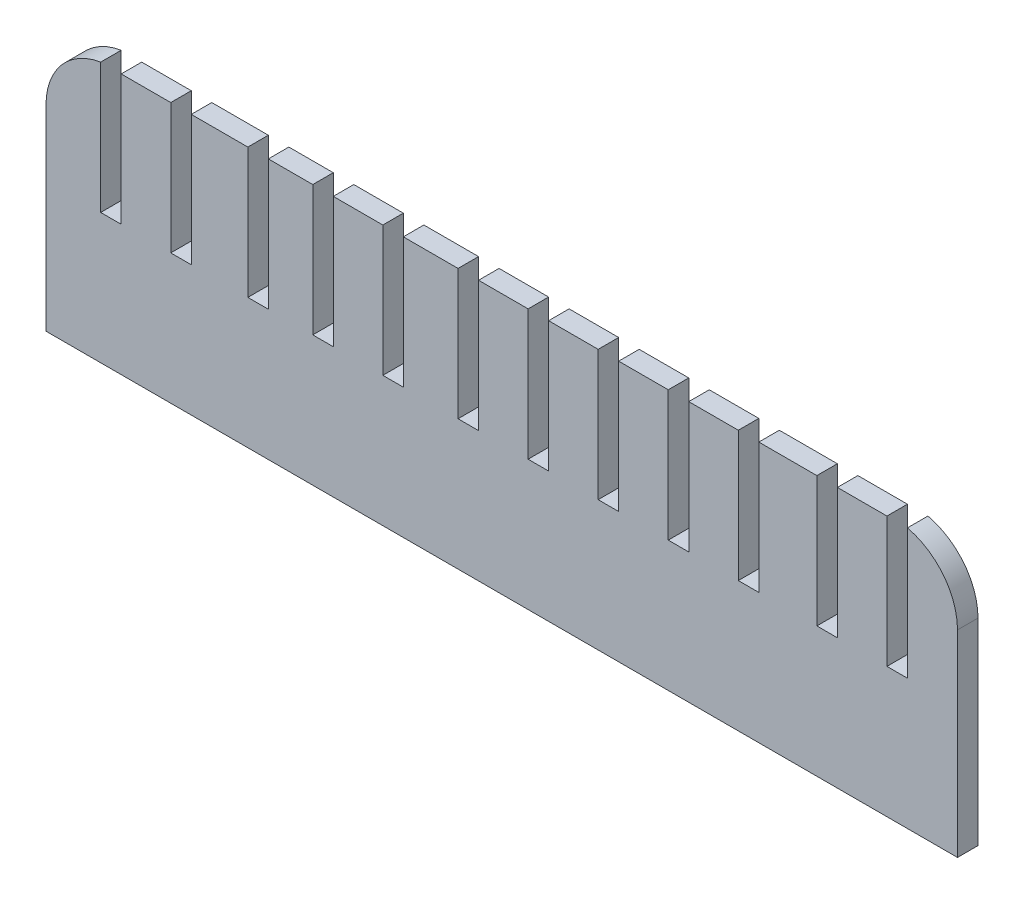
ISO-10303-21;
HEADER;
FILE_DESCRIPTION(('STEP AP214'),'2;1');
FILE_NAME('part.step','',(''),(''),'','','');
FILE_SCHEMA(('AUTOMOTIVE_DESIGN { 1 0 10303 214 1 1 1 1 }'));
ENDSEC;
DATA;
#1=APPLICATION_CONTEXT('core data for automotive mechanical design processes');
#2=APPLICATION_PROTOCOL_DEFINITION('international standard','automotive_design',2000,#1);
#3=PRODUCT_CONTEXT('',#1,'mechanical');
#4=PRODUCT('Part','Part','',(#3));
#5=PRODUCT_RELATED_PRODUCT_CATEGORY('part','',(#4));
#6=PRODUCT_DEFINITION_FORMATION('','',#4);
#7=PRODUCT_DEFINITION_CONTEXT('part definition',#1,'design');
#8=PRODUCT_DEFINITION('design','',#6,#7);
#9=PRODUCT_DEFINITION_SHAPE('','',#8);
#10=(LENGTH_UNIT() NAMED_UNIT(*) SI_UNIT(.MILLI.,.METRE.));
#11=(NAMED_UNIT(*) PLANE_ANGLE_UNIT() SI_UNIT($,.RADIAN.));
#12=(NAMED_UNIT(*) SI_UNIT($,.STERADIAN.) SOLID_ANGLE_UNIT());
#13=UNCERTAINTY_MEASURE_WITH_UNIT(LENGTH_MEASURE(1.E-05),#10,'distance_accuracy_value','');
#14=(GEOMETRIC_REPRESENTATION_CONTEXT(3) GLOBAL_UNCERTAINTY_ASSIGNED_CONTEXT((#13)) GLOBAL_UNIT_ASSIGNED_CONTEXT((#10,
#11,#12)) REPRESENTATION_CONTEXT('',''));
#15=CARTESIAN_POINT('',(0.,0.,0.));
#16=DIRECTION('',(0.,0.,1.));
#17=DIRECTION('',(1.,0.,0.));
#18=AXIS2_PLACEMENT_3D('',#15,#16,#17);
#19=CARTESIAN_POINT('',(-74.231999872,233.224942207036,4.000000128));
#20=DIRECTION('',(1.,0.,0.));
#21=DIRECTION('',(0.,0.,-1.));
#22=AXIS2_PLACEMENT_3D('',#19,#20,#21);
#23=PLANE('',#22);
#24=DIRECTION('',(0.,-1.,0.));
#25=VECTOR('',#24,1.);
#26=CARTESIAN_POINT('',(-74.231999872,233.224942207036,0.));
#27=LINE('',#26,#25);
#28=CARTESIAN_POINT('',(-74.231999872,233.224942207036,0.));
#29=VERTEX_POINT('',#28);
#30=CARTESIAN_POINT('',(-74.231999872,207.824942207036,0.));
#31=VERTEX_POINT('',#30);
#32=EDGE_CURVE('E385',#29,#31,#27,.T.);
#33=ORIENTED_EDGE('',*,*,#32,.T.);
#34=DIRECTION('',(0.,0.,-1.));
#35=VECTOR('',#34,1.);
#36=CARTESIAN_POINT('',(-74.231999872,207.824942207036,4.000000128));
#37=LINE('',#36,#35);
#38=CARTESIAN_POINT('',(-74.231999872,207.824942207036,4.000000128));
#39=VERTEX_POINT('',#38);
#40=EDGE_CURVE('E366',#39,#31,#37,.T.);
#41=ORIENTED_EDGE('',*,*,#40,.F.);
#42=DIRECTION('',(0.,-1.,0.));
#43=VECTOR('',#42,1.);
#44=CARTESIAN_POINT('',(-74.231999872,233.224942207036,4.000000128));
#45=LINE('',#44,#43);
#46=CARTESIAN_POINT('',(-74.231999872,233.224942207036,4.000000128));
#47=VERTEX_POINT('',#46);
#48=EDGE_CURVE('E373',#47,#39,#45,.T.);
#49=ORIENTED_EDGE('',*,*,#48,.F.);
#50=DIRECTION('',(0.,0.,-1.));
#51=VECTOR('',#50,1.);
#52=CARTESIAN_POINT('',(-74.231999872,233.224942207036,4.000000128));
#53=LINE('',#52,#51);
#54=EDGE_CURVE('E520',#47,#29,#53,.T.);
#55=ORIENTED_EDGE('',*,*,#54,.T.);
#56=EDGE_LOOP('',(#33,#41,#49,#55));
#57=FACE_BOUND('',#56,.T.);
#58=ADVANCED_FACE('F33',(#57),#23,.F.);
#59=CARTESIAN_POINT('',(-78.232,207.824942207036,4.000000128));
#60=DIRECTION('',(0.,-1.,0.));
#61=DIRECTION('',(0.,0.,-1.));
#62=AXIS2_PLACEMENT_3D('',#59,#60,#61);
#63=PLANE('',#62);
#64=DIRECTION('',(-1.,0.,0.));
#65=VECTOR('',#64,1.);
#66=CARTESIAN_POINT('',(-78.232,207.824942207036,0.));
#67=LINE('',#66,#65);
#68=CARTESIAN_POINT('',(-78.232,207.824942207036,0.));
#69=VERTEX_POINT('',#68);
#70=EDGE_CURVE('E423',#31,#69,#67,.T.);
#71=ORIENTED_EDGE('',*,*,#70,.T.);
#72=DIRECTION('',(0.,0.,-1.));
#73=VECTOR('',#72,1.);
#74=CARTESIAN_POINT('',(-78.232,207.824942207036,4.000000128));
#75=LINE('',#74,#73);
#76=CARTESIAN_POINT('',(-78.232,207.824942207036,4.000000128));
#77=VERTEX_POINT('',#76);
#78=EDGE_CURVE('E369',#77,#69,#75,.T.);
#79=ORIENTED_EDGE('',*,*,#78,.F.);
#80=DIRECTION('',(-1.,0.,0.));
#81=VECTOR('',#80,1.);
#82=CARTESIAN_POINT('',(-78.232,207.824942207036,4.000000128));
#83=LINE('',#82,#81);
#84=EDGE_CURVE('E362',#39,#77,#83,.T.);
#85=ORIENTED_EDGE('',*,*,#84,.F.);
#86=ORIENTED_EDGE('',*,*,#40,.T.);
#87=EDGE_LOOP('',(#71,#79,#85,#86));
#88=FACE_BOUND('',#87,.T.);
#89=ADVANCED_FACE('F364',(#88),#63,.F.);
#90=CARTESIAN_POINT('',(-78.232,233.224942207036,4.000000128));
#91=DIRECTION('',(-1.,0.,0.));
#92=DIRECTION('',(0.,0.,1.));
#93=AXIS2_PLACEMENT_3D('',#90,#91,#92);
#94=PLANE('',#93);
#95=DIRECTION('',(0.,1.,0.));
#96=VECTOR('',#95,1.);
#97=CARTESIAN_POINT('',(-78.232,233.224942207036,0.));
#98=LINE('',#97,#96);
#99=CARTESIAN_POINT('',(-78.232,233.224942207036,0.));
#100=VERTEX_POINT('',#99);
#101=EDGE_CURVE('E418',#69,#100,#98,.T.);
#102=ORIENTED_EDGE('',*,*,#101,.T.);
#103=DIRECTION('',(0.,0.,-1.));
#104=VECTOR('',#103,1.);
#105=CARTESIAN_POINT('',(-78.232,233.224942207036,4.000000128));
#106=LINE('',#105,#104);
#107=CARTESIAN_POINT('',(-78.232,233.224942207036,4.000000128));
#108=VERTEX_POINT('',#107);
#109=EDGE_CURVE('E391',#108,#100,#106,.T.);
#110=ORIENTED_EDGE('',*,*,#109,.F.);
#111=DIRECTION('',(0.,1.,0.));
#112=VECTOR('',#111,1.);
#113=CARTESIAN_POINT('',(-78.232,233.224942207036,4.000000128));
#114=LINE('',#113,#112);
#115=EDGE_CURVE('E372',#77,#108,#114,.T.);
#116=ORIENTED_EDGE('',*,*,#115,.F.);
#117=ORIENTED_EDGE('',*,*,#78,.T.);
#118=EDGE_LOOP('',(#102,#110,#116,#117));
#119=FACE_BOUND('',#118,.T.);
#120=ADVANCED_FACE('F422',(#119),#94,.F.);
#121=CARTESIAN_POINT('',(-88.9,182.424942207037,4.000000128));
#122=DIRECTION('',(1.,0.,0.));
#123=DIRECTION('',(0.,0.,-1.));
#124=AXIS2_PLACEMENT_3D('',#121,#122,#123);
#125=PLANE('',#124);
#126=DIRECTION('',(0.,-1.,0.));
#127=VECTOR('',#126,1.);
#128=CARTESIAN_POINT('',(-88.9,182.424942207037,4.000000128));
#129=LINE('',#128,#127);
#130=CARTESIAN_POINT('',(-88.9,220.688556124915,4.000000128));
#131=VERTEX_POINT('',#130);
#132=CARTESIAN_POINT('',(-88.9,182.424942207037,4.000000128));
#133=VERTEX_POINT('',#132);
#134=EDGE_CURVE('E400',#131,#133,#129,.T.);
#135=ORIENTED_EDGE('',*,*,#134,.F.);
#136=DIRECTION('',(0.,0.,-1.));
#137=VECTOR('',#136,1.);
#138=CARTESIAN_POINT('',(-88.9,220.688556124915,4.000000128));
#139=LINE('',#138,#137);
#140=CARTESIAN_POINT('',(-88.9,220.688556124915,0.));
#141=VERTEX_POINT('',#140);
#142=EDGE_CURVE('E386',#131,#141,#139,.T.);
#143=ORIENTED_EDGE('',*,*,#142,.T.);
#144=DIRECTION('',(0.,-1.,0.));
#145=VECTOR('',#144,1.);
#146=CARTESIAN_POINT('',(-88.9,182.424942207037,0.));
#147=LINE('',#146,#145);
#148=CARTESIAN_POINT('',(-88.9,182.424942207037,0.));
#149=VERTEX_POINT('',#148);
#150=EDGE_CURVE('E420',#141,#149,#147,.T.);
#151=ORIENTED_EDGE('',*,*,#150,.T.);
#152=DIRECTION('',(0.,0.,-1.));
#153=VECTOR('',#152,1.);
#154=CARTESIAN_POINT('',(-88.9,182.424942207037,4.000000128));
#155=LINE('',#154,#153);
#156=EDGE_CURVE('E410',#133,#149,#155,.T.);
#157=ORIENTED_EDGE('',*,*,#156,.F.);
#158=EDGE_LOOP('',(#135,#143,#151,#157));
#159=FACE_BOUND('',#158,.T.);
#160=ADVANCED_FACE('F407',(#159),#125,.F.);
#161=CARTESIAN_POINT('',(50.8,182.424942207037,4.000000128));
#162=DIRECTION('',(0.,1.,0.));
#163=DIRECTION('',(0.,0.,1.));
#164=AXIS2_PLACEMENT_3D('',#161,#162,#163);
#165=PLANE('',#164);
#166=DIRECTION('',(1.,0.,0.));
#167=VECTOR('',#166,1.);
#168=CARTESIAN_POINT('',(50.8,182.424942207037,0.));
#169=LINE('',#168,#167);
#170=CARTESIAN_POINT('',(88.9,182.424942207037,0.));
#171=VERTEX_POINT('',#170);
#172=EDGE_CURVE('E425',#149,#171,#169,.T.);
#173=ORIENTED_EDGE('',*,*,#172,.T.);
#174=DIRECTION('',(0.,0.,-1.));
#175=VECTOR('',#174,1.);
#176=CARTESIAN_POINT('',(88.9,182.424942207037,4.000000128));
#177=LINE('',#176,#175);
#178=CARTESIAN_POINT('',(88.9,182.424942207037,4.000000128));
#179=VERTEX_POINT('',#178);
#180=EDGE_CURVE('E654',#179,#171,#177,.T.);
#181=ORIENTED_EDGE('',*,*,#180,.F.);
#182=DIRECTION('',(1.,0.,0.));
#183=VECTOR('',#182,1.);
#184=CARTESIAN_POINT('',(-50.8,182.424942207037,4.000000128));
#185=LINE('',#184,#183);
#186=EDGE_CURVE('E412',#133,#179,#185,.T.);
#187=ORIENTED_EDGE('',*,*,#186,.F.);
#188=ORIENTED_EDGE('',*,*,#156,.T.);
#189=EDGE_LOOP('',(#173,#181,#187,#188));
#190=FACE_BOUND('',#189,.T.);
#191=ADVANCED_FACE('F658',(#190),#165,.F.);
#192=CARTESIAN_POINT('',(88.9,182.424942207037,4.000000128));
#193=DIRECTION('',(-1.,0.,0.));
#194=DIRECTION('',(0.,0.,1.));
#195=AXIS2_PLACEMENT_3D('',#192,#193,#194);
#196=PLANE('',#195);
#197=DIRECTION('',(0.,1.,0.));
#198=VECTOR('',#197,1.);
#199=CARTESIAN_POINT('',(88.9,182.424942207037,0.));
#200=LINE('',#199,#198);
#201=CARTESIAN_POINT('',(88.9,220.868975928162,0.));
#202=VERTEX_POINT('',#201);
#203=EDGE_CURVE('E431',#171,#202,#200,.T.);
#204=ORIENTED_EDGE('',*,*,#203,.T.);
#205=DIRECTION('',(0.,0.,1.));
#206=VECTOR('',#205,1.);
#207=CARTESIAN_POINT('',(88.9,220.868975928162,4.000000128));
#208=LINE('',#207,#206);
#209=CARTESIAN_POINT('',(88.9,220.868975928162,4.000000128));
#210=VERTEX_POINT('',#209);
#211=EDGE_CURVE('E41',#202,#210,#208,.T.);
#212=ORIENTED_EDGE('',*,*,#211,.T.);
#213=DIRECTION('',(0.,1.,0.));
#214=VECTOR('',#213,1.);
#215=CARTESIAN_POINT('',(88.9,182.424942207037,4.000000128));
#216=LINE('',#215,#214);
#217=EDGE_CURVE('E660',#179,#210,#216,.T.);
#218=ORIENTED_EDGE('',*,*,#217,.F.);
#219=ORIENTED_EDGE('',*,*,#180,.T.);
#220=EDGE_LOOP('',(#204,#212,#218,#219));
#221=FACE_BOUND('',#220,.T.);
#222=ADVANCED_FACE('F971',(#221),#196,.F.);
#223=CARTESIAN_POINT('',(79.136000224,233.224942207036,4.000000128));
#224=DIRECTION('',(1.,0.,0.));
#225=DIRECTION('',(0.,0.,-1.));
#226=AXIS2_PLACEMENT_3D('',#223,#224,#225);
#227=PLANE('',#226);
#228=DIRECTION('',(0.,-1.,0.));
#229=VECTOR('',#228,1.);
#230=CARTESIAN_POINT('',(79.136000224,233.224942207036,0.));
#231=LINE('',#230,#229);
#232=CARTESIAN_POINT('',(79.136000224,233.224942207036,0.));
#233=VERTEX_POINT('',#232);
#234=CARTESIAN_POINT('',(79.136000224,207.824942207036,0.));
#235=VERTEX_POINT('',#234);
#236=EDGE_CURVE('E433',#233,#235,#231,.T.);
#237=ORIENTED_EDGE('',*,*,#236,.T.);
#238=DIRECTION('',(0.,0.,-1.));
#239=VECTOR('',#238,1.);
#240=CARTESIAN_POINT('',(79.136000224,207.824942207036,4.000000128));
#241=LINE('',#240,#239);
#242=CARTESIAN_POINT('',(79.136000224,207.824942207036,4.000000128));
#243=VERTEX_POINT('',#242);
#244=EDGE_CURVE('E648',#243,#235,#241,.T.);
#245=ORIENTED_EDGE('',*,*,#244,.F.);
#246=DIRECTION('',(0.,-1.,0.));
#247=VECTOR('',#246,1.);
#248=CARTESIAN_POINT('',(79.136000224,233.224942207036,4.000000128));
#249=LINE('',#248,#247);
#250=CARTESIAN_POINT('',(79.136000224,233.224942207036,4.000000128));
#251=VERTEX_POINT('',#250);
#252=EDGE_CURVE('E662',#251,#243,#249,.T.);
#253=ORIENTED_EDGE('',*,*,#252,.F.);
#254=DIRECTION('',(0.,0.,-1.));
#255=VECTOR('',#254,1.);
#256=CARTESIAN_POINT('',(79.136000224,233.224942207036,4.000000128));
#257=LINE('',#256,#255);
#258=EDGE_CURVE('E651',#251,#233,#257,.T.);
#259=ORIENTED_EDGE('',*,*,#258,.T.);
#260=EDGE_LOOP('',(#237,#245,#253,#259));
#261=FACE_BOUND('',#260,.T.);
#262=ADVANCED_FACE('F967',(#261),#227,.F.);
#263=CARTESIAN_POINT('',(75.136000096,207.824942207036,4.000000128));
#264=DIRECTION('',(0.,-1.,0.));
#265=DIRECTION('',(0.,0.,-1.));
#266=AXIS2_PLACEMENT_3D('',#263,#264,#265);
#267=PLANE('',#266);
#268=DIRECTION('',(-1.,0.,0.));
#269=VECTOR('',#268,1.);
#270=CARTESIAN_POINT('',(75.136000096,207.824942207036,0.));
#271=LINE('',#270,#269);
#272=CARTESIAN_POINT('',(75.136000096,207.824942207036,0.));
#273=VERTEX_POINT('',#272);
#274=EDGE_CURVE('E435',#235,#273,#271,.T.);
#275=ORIENTED_EDGE('',*,*,#274,.T.);
#276=DIRECTION('',(0.,0.,-1.));
#277=VECTOR('',#276,1.);
#278=CARTESIAN_POINT('',(75.136000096,207.824942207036,4.000000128));
#279=LINE('',#278,#277);
#280=CARTESIAN_POINT('',(75.136000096,207.824942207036,4.000000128));
#281=VERTEX_POINT('',#280);
#282=EDGE_CURVE('E645',#281,#273,#279,.T.);
#283=ORIENTED_EDGE('',*,*,#282,.F.);
#284=DIRECTION('',(-1.,0.,0.));
#285=VECTOR('',#284,1.);
#286=CARTESIAN_POINT('',(75.136000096,207.824942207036,4.000000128));
#287=LINE('',#286,#285);
#288=EDGE_CURVE('E667',#243,#281,#287,.T.);
#289=ORIENTED_EDGE('',*,*,#288,.F.);
#290=ORIENTED_EDGE('',*,*,#244,.T.);
#291=EDGE_LOOP('',(#275,#283,#289,#290));
#292=FACE_BOUND('',#291,.T.);
#293=ADVANCED_FACE('F963',(#292),#267,.F.);
#294=CARTESIAN_POINT('',(75.136000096,233.224942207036,4.000000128));
#295=DIRECTION('',(-1.,0.,0.));
#296=DIRECTION('',(0.,0.,1.));
#297=AXIS2_PLACEMENT_3D('',#294,#295,#296);
#298=PLANE('',#297);
#299=DIRECTION('',(0.,1.,0.));
#300=VECTOR('',#299,1.);
#301=CARTESIAN_POINT('',(75.136000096,233.224942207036,0.));
#302=LINE('',#301,#300);
#303=CARTESIAN_POINT('',(75.136000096,233.224942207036,0.));
#304=VERTEX_POINT('',#303);
#305=EDGE_CURVE('E437',#273,#304,#302,.T.);
#306=ORIENTED_EDGE('',*,*,#305,.T.);
#307=DIRECTION('',(0.,0.,-1.));
#308=VECTOR('',#307,1.);
#309=CARTESIAN_POINT('',(75.136000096,233.224942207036,4.000000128));
#310=LINE('',#309,#308);
#311=CARTESIAN_POINT('',(75.136000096,233.224942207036,4.000000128));
#312=VERTEX_POINT('',#311);
#313=EDGE_CURVE('E642',#312,#304,#310,.T.);
#314=ORIENTED_EDGE('',*,*,#313,.F.);
#315=DIRECTION('',(0.,1.,0.));
#316=VECTOR('',#315,1.);
#317=CARTESIAN_POINT('',(75.136000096,233.224942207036,4.000000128));
#318=LINE('',#317,#316);
#319=EDGE_CURVE('E669',#281,#312,#318,.T.);
#320=ORIENTED_EDGE('',*,*,#319,.F.);
#321=ORIENTED_EDGE('',*,*,#282,.T.);
#322=EDGE_LOOP('',(#306,#314,#320,#321));
#323=FACE_BOUND('',#322,.T.);
#324=ADVANCED_FACE('F958',(#323),#298,.F.);
#325=CARTESIAN_POINT('',(65.468000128,233.224942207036,4.000000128));
#326=DIRECTION('',(0.,-1.,0.));
#327=DIRECTION('',(0.,0.,-1.));
#328=AXIS2_PLACEMENT_3D('',#325,#326,#327);
#329=PLANE('',#328);
#330=DIRECTION('',(-1.,0.,0.));
#331=VECTOR('',#330,1.);
#332=CARTESIAN_POINT('',(65.468000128,233.224942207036,0.));
#333=LINE('',#332,#331);
#334=CARTESIAN_POINT('',(65.468000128,233.224942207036,0.));
#335=VERTEX_POINT('',#334);
#336=EDGE_CURVE('E439',#304,#335,#333,.T.);
#337=ORIENTED_EDGE('',*,*,#336,.T.);
#338=DIRECTION('',(0.,0.,-1.));
#339=VECTOR('',#338,1.);
#340=CARTESIAN_POINT('',(65.468000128,233.224942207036,4.000000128));
#341=LINE('',#340,#339);
#342=CARTESIAN_POINT('',(65.468000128,233.224942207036,4.000000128));
#343=VERTEX_POINT('',#342);
#344=EDGE_CURVE('E639',#343,#335,#341,.T.);
#345=ORIENTED_EDGE('',*,*,#344,.F.);
#346=DIRECTION('',(-1.,0.,0.));
#347=VECTOR('',#346,1.);
#348=CARTESIAN_POINT('',(65.468000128,233.224942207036,4.000000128));
#349=LINE('',#348,#347);
#350=EDGE_CURVE('E671',#312,#343,#349,.T.);
#351=ORIENTED_EDGE('',*,*,#350,.F.);
#352=ORIENTED_EDGE('',*,*,#313,.T.);
#353=EDGE_LOOP('',(#337,#345,#351,#352));
#354=FACE_BOUND('',#353,.T.);
#355=ADVANCED_FACE('F953',(#354),#329,.F.);
#356=CARTESIAN_POINT('',(65.468000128,233.224942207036,4.000000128));
#357=DIRECTION('',(1.,0.,0.));
#358=DIRECTION('',(0.,0.,-1.));
#359=AXIS2_PLACEMENT_3D('',#356,#357,#358);
#360=PLANE('',#359);
#361=DIRECTION('',(0.,-1.,0.));
#362=VECTOR('',#361,1.);
#363=CARTESIAN_POINT('',(65.468000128,233.224942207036,0.));
#364=LINE('',#363,#362);
#365=CARTESIAN_POINT('',(65.468000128,207.824942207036,0.));
#366=VERTEX_POINT('',#365);
#367=EDGE_CURVE('E441',#335,#366,#364,.T.);
#368=ORIENTED_EDGE('',*,*,#367,.T.);
#369=DIRECTION('',(0.,0.,-1.));
#370=VECTOR('',#369,1.);
#371=CARTESIAN_POINT('',(65.468000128,207.824942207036,4.000000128));
#372=LINE('',#371,#370);
#373=CARTESIAN_POINT('',(65.468000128,207.824942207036,4.000000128));
#374=VERTEX_POINT('',#373);
#375=EDGE_CURVE('E636',#374,#366,#372,.T.);
#376=ORIENTED_EDGE('',*,*,#375,.F.);
#377=DIRECTION('',(0.,-1.,0.));
#378=VECTOR('',#377,1.);
#379=CARTESIAN_POINT('',(65.468000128,233.224942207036,4.000000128));
#380=LINE('',#379,#378);
#381=EDGE_CURVE('E673',#343,#374,#380,.T.);
#382=ORIENTED_EDGE('',*,*,#381,.F.);
#383=ORIENTED_EDGE('',*,*,#344,.T.);
#384=EDGE_LOOP('',(#368,#376,#382,#383));
#385=FACE_BOUND('',#384,.T.);
#386=ADVANCED_FACE('F949',(#385),#360,.F.);
#387=CARTESIAN_POINT('',(61.468,207.824942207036,4.000000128));
#388=DIRECTION('',(0.,-1.,0.));
#389=DIRECTION('',(0.,0.,-1.));
#390=AXIS2_PLACEMENT_3D('',#387,#388,#389);
#391=PLANE('',#390);
#392=DIRECTION('',(-1.,0.,0.));
#393=VECTOR('',#392,1.);
#394=CARTESIAN_POINT('',(61.468,207.824942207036,0.));
#395=LINE('',#394,#393);
#396=CARTESIAN_POINT('',(61.468,207.824942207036,0.));
#397=VERTEX_POINT('',#396);
#398=EDGE_CURVE('E443',#366,#397,#395,.T.);
#399=ORIENTED_EDGE('',*,*,#398,.T.);
#400=DIRECTION('',(0.,0.,-1.));
#401=VECTOR('',#400,1.);
#402=CARTESIAN_POINT('',(61.468,207.824942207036,4.000000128));
#403=LINE('',#402,#401);
#404=CARTESIAN_POINT('',(61.468,207.824942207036,4.000000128));
#405=VERTEX_POINT('',#404);
#406=EDGE_CURVE('E633',#405,#397,#403,.T.);
#407=ORIENTED_EDGE('',*,*,#406,.F.);
#408=DIRECTION('',(-1.,0.,0.));
#409=VECTOR('',#408,1.);
#410=CARTESIAN_POINT('',(61.468,207.824942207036,4.000000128));
#411=LINE('',#410,#409);
#412=EDGE_CURVE('E675',#374,#405,#411,.T.);
#413=ORIENTED_EDGE('',*,*,#412,.F.);
#414=ORIENTED_EDGE('',*,*,#375,.T.);
#415=EDGE_LOOP('',(#399,#407,#413,#414));
#416=FACE_BOUND('',#415,.T.);
#417=ADVANCED_FACE('F944',(#416),#391,.F.);
#418=CARTESIAN_POINT('',(61.468,233.224942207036,4.000000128));
#419=DIRECTION('',(-1.,0.,0.));
#420=DIRECTION('',(0.,0.,1.));
#421=AXIS2_PLACEMENT_3D('',#418,#419,#420);
#422=PLANE('',#421);
#423=DIRECTION('',(0.,1.,0.));
#424=VECTOR('',#423,1.);
#425=CARTESIAN_POINT('',(61.468,233.224942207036,0.));
#426=LINE('',#425,#424);
#427=CARTESIAN_POINT('',(61.468,233.224942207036,0.));
#428=VERTEX_POINT('',#427);
#429=EDGE_CURVE('E445',#397,#428,#426,.T.);
#430=ORIENTED_EDGE('',*,*,#429,.T.);
#431=DIRECTION('',(0.,0.,-1.));
#432=VECTOR('',#431,1.);
#433=CARTESIAN_POINT('',(61.468,233.224942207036,4.000000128));
#434=LINE('',#433,#432);
#435=CARTESIAN_POINT('',(61.468,233.224942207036,4.000000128));
#436=VERTEX_POINT('',#435);
#437=EDGE_CURVE('E630',#436,#428,#434,.T.);
#438=ORIENTED_EDGE('',*,*,#437,.F.);
#439=DIRECTION('',(0.,1.,0.));
#440=VECTOR('',#439,1.);
#441=CARTESIAN_POINT('',(61.468,233.224942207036,4.000000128));
#442=LINE('',#441,#440);
#443=EDGE_CURVE('E677',#405,#436,#442,.T.);
#444=ORIENTED_EDGE('',*,*,#443,.F.);
#445=ORIENTED_EDGE('',*,*,#406,.T.);
#446=EDGE_LOOP('',(#430,#438,#444,#445));
#447=FACE_BOUND('',#446,.T.);
#448=ADVANCED_FACE('F938',(#447),#422,.F.);
#449=CARTESIAN_POINT('',(50.1460008,233.224942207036,4.000000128));
#450=DIRECTION('',(0.,-1.,0.));
#451=DIRECTION('',(0.,0.,-1.));
#452=AXIS2_PLACEMENT_3D('',#449,#450,#451);
#453=PLANE('',#452);
#454=DIRECTION('',(-1.,0.,0.));
#455=VECTOR('',#454,1.);
#456=CARTESIAN_POINT('',(50.1460008,233.224942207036,0.));
#457=LINE('',#456,#455);
#458=CARTESIAN_POINT('',(50.1460008,233.224942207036,0.));
#459=VERTEX_POINT('',#458);
#460=EDGE_CURVE('E447',#428,#459,#457,.T.);
#461=ORIENTED_EDGE('',*,*,#460,.T.);
#462=DIRECTION('',(0.,0.,-1.));
#463=VECTOR('',#462,1.);
#464=CARTESIAN_POINT('',(50.1460008,233.224942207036,4.000000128));
#465=LINE('',#464,#463);
#466=CARTESIAN_POINT('',(50.1460008,233.224942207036,4.000000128));
#467=VERTEX_POINT('',#466);
#468=EDGE_CURVE('E627',#467,#459,#465,.T.);
#469=ORIENTED_EDGE('',*,*,#468,.F.);
#470=DIRECTION('',(-1.,0.,0.));
#471=VECTOR('',#470,1.);
#472=CARTESIAN_POINT('',(50.1460008,233.224942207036,4.000000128));
#473=LINE('',#472,#471);
#474=EDGE_CURVE('E679',#436,#467,#473,.T.);
#475=ORIENTED_EDGE('',*,*,#474,.F.);
#476=ORIENTED_EDGE('',*,*,#437,.T.);
#477=EDGE_LOOP('',(#461,#469,#475,#476));
#478=FACE_BOUND('',#477,.T.);
#479=ADVANCED_FACE('F934',(#478),#453,.F.);
#480=CARTESIAN_POINT('',(50.1460008,233.224942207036,4.000000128));
#481=DIRECTION('',(1.,0.,0.));
#482=DIRECTION('',(0.,0.,-1.));
#483=AXIS2_PLACEMENT_3D('',#480,#481,#482);
#484=PLANE('',#483);
#485=DIRECTION('',(0.,-1.,0.));
#486=VECTOR('',#485,1.);
#487=CARTESIAN_POINT('',(50.1460008,233.224942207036,0.));
#488=LINE('',#487,#486);
#489=CARTESIAN_POINT('',(50.1460008,207.824942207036,0.));
#490=VERTEX_POINT('',#489);
#491=EDGE_CURVE('E449',#459,#490,#488,.T.);
#492=ORIENTED_EDGE('',*,*,#491,.T.);
#493=DIRECTION('',(0.,0.,-1.));
#494=VECTOR('',#493,1.);
#495=CARTESIAN_POINT('',(50.1460008,207.824942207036,4.000000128));
#496=LINE('',#495,#494);
#497=CARTESIAN_POINT('',(50.1460008,207.824942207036,4.000000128));
#498=VERTEX_POINT('',#497);
#499=EDGE_CURVE('E624',#498,#490,#496,.T.);
#500=ORIENTED_EDGE('',*,*,#499,.F.);
#501=DIRECTION('',(0.,-1.,0.));
#502=VECTOR('',#501,1.);
#503=CARTESIAN_POINT('',(50.1460008,233.224942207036,4.000000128));
#504=LINE('',#503,#502);
#505=EDGE_CURVE('E681',#467,#498,#504,.T.);
#506=ORIENTED_EDGE('',*,*,#505,.F.);
#507=ORIENTED_EDGE('',*,*,#468,.T.);
#508=EDGE_LOOP('',(#492,#500,#506,#507));
#509=FACE_BOUND('',#508,.T.);
#510=ADVANCED_FACE('F929',(#509),#484,.F.);
#511=CARTESIAN_POINT('',(46.146000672,207.824942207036,4.000000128));
#512=DIRECTION('',(0.,-1.,0.));
#513=DIRECTION('',(0.,0.,-1.));
#514=AXIS2_PLACEMENT_3D('',#511,#512,#513);
#515=PLANE('',#514);
#516=DIRECTION('',(-1.,0.,0.));
#517=VECTOR('',#516,1.);
#518=CARTESIAN_POINT('',(46.146000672,207.824942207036,0.));
#519=LINE('',#518,#517);
#520=CARTESIAN_POINT('',(46.146000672,207.824942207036,0.));
#521=VERTEX_POINT('',#520);
#522=EDGE_CURVE('E451',#490,#521,#519,.T.);
#523=ORIENTED_EDGE('',*,*,#522,.T.);
#524=DIRECTION('',(0.,0.,-1.));
#525=VECTOR('',#524,1.);
#526=CARTESIAN_POINT('',(46.146000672,207.824942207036,4.000000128));
#527=LINE('',#526,#525);
#528=CARTESIAN_POINT('',(46.146000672,207.824942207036,4.000000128));
#529=VERTEX_POINT('',#528);
#530=EDGE_CURVE('E621',#529,#521,#527,.T.);
#531=ORIENTED_EDGE('',*,*,#530,.F.);
#532=DIRECTION('',(-1.,0.,0.));
#533=VECTOR('',#532,1.);
#534=CARTESIAN_POINT('',(46.146000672,207.824942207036,4.000000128));
#535=LINE('',#534,#533);
#536=EDGE_CURVE('E683',#498,#529,#535,.T.);
#537=ORIENTED_EDGE('',*,*,#536,.F.);
#538=ORIENTED_EDGE('',*,*,#499,.T.);
#539=EDGE_LOOP('',(#523,#531,#537,#538));
#540=FACE_BOUND('',#539,.T.);
#541=ADVANCED_FACE('F923',(#540),#515,.F.);
#542=CARTESIAN_POINT('',(46.146000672,233.224942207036,4.000000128));
#543=DIRECTION('',(-1.,0.,0.));
#544=DIRECTION('',(0.,-1.,0.));
#545=AXIS2_PLACEMENT_3D('',#542,#543,#544);
#546=PLANE('',#545);
#547=DIRECTION('',(0.,1.,0.));
#548=VECTOR('',#547,1.);
#549=CARTESIAN_POINT('',(46.146000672,233.224942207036,0.));
#550=LINE('',#549,#548);
#551=CARTESIAN_POINT('',(46.146000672,233.224942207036,0.));
#552=VERTEX_POINT('',#551);
#553=EDGE_CURVE('E453',#521,#552,#550,.T.);
#554=ORIENTED_EDGE('',*,*,#553,.T.);
#555=DIRECTION('',(0.,0.,-1.));
#556=VECTOR('',#555,1.);
#557=CARTESIAN_POINT('',(46.146000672,233.224942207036,4.000000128));
#558=LINE('',#557,#556);
#559=CARTESIAN_POINT('',(46.146000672,233.224942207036,4.000000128));
#560=VERTEX_POINT('',#559);
#561=EDGE_CURVE('E618',#560,#552,#558,.T.);
#562=ORIENTED_EDGE('',*,*,#561,.F.);
#563=DIRECTION('',(0.,1.,0.));
#564=VECTOR('',#563,1.);
#565=CARTESIAN_POINT('',(46.146000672,233.224942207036,4.000000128));
#566=LINE('',#565,#564);
#567=EDGE_CURVE('E685',#529,#560,#566,.T.);
#568=ORIENTED_EDGE('',*,*,#567,.F.);
#569=ORIENTED_EDGE('',*,*,#530,.T.);
#570=EDGE_LOOP('',(#554,#562,#568,#569));
#571=FACE_BOUND('',#570,.T.);
#572=ADVANCED_FACE('F919',(#571),#546,.F.);
#573=CARTESIAN_POINT('',(36.478000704,233.224942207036,4.000000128));
#574=DIRECTION('',(0.,-1.,0.));
#575=DIRECTION('',(0.,0.,-1.));
#576=AXIS2_PLACEMENT_3D('',#573,#574,#575);
#577=PLANE('',#576);
#578=DIRECTION('',(-1.,0.,0.));
#579=VECTOR('',#578,1.);
#580=CARTESIAN_POINT('',(36.478000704,233.224942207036,0.));
#581=LINE('',#580,#579);
#582=CARTESIAN_POINT('',(36.478000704,233.224942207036,0.));
#583=VERTEX_POINT('',#582);
#584=EDGE_CURVE('E455',#552,#583,#581,.T.);
#585=ORIENTED_EDGE('',*,*,#584,.T.);
#586=DIRECTION('',(0.,0.,-1.));
#587=VECTOR('',#586,1.);
#588=CARTESIAN_POINT('',(36.478000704,233.224942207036,4.000000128));
#589=LINE('',#588,#587);
#590=CARTESIAN_POINT('',(36.478000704,233.224942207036,4.000000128));
#591=VERTEX_POINT('',#590);
#592=EDGE_CURVE('E615',#591,#583,#589,.T.);
#593=ORIENTED_EDGE('',*,*,#592,.F.);
#594=DIRECTION('',(-1.,0.,0.));
#595=VECTOR('',#594,1.);
#596=CARTESIAN_POINT('',(36.478000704,233.224942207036,4.000000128));
#597=LINE('',#596,#595);
#598=EDGE_CURVE('E687',#560,#591,#597,.T.);
#599=ORIENTED_EDGE('',*,*,#598,.F.);
#600=ORIENTED_EDGE('',*,*,#561,.T.);
#601=EDGE_LOOP('',(#585,#593,#599,#600));
#602=FACE_BOUND('',#601,.T.);
#603=ADVANCED_FACE('F914',(#602),#577,.F.);
#604=CARTESIAN_POINT('',(36.478000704,233.224942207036,4.000000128));
#605=DIRECTION('',(1.,0.,0.));
#606=DIRECTION('',(0.,0.,-1.));
#607=AXIS2_PLACEMENT_3D('',#604,#605,#606);
#608=PLANE('',#607);
#609=DIRECTION('',(0.,-1.,0.));
#610=VECTOR('',#609,1.);
#611=CARTESIAN_POINT('',(36.478000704,233.224942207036,0.));
#612=LINE('',#611,#610);
#613=CARTESIAN_POINT('',(36.478000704,207.824942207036,0.));
#614=VERTEX_POINT('',#613);
#615=EDGE_CURVE('E457',#583,#614,#612,.T.);
#616=ORIENTED_EDGE('',*,*,#615,.T.);
#617=DIRECTION('',(0.,0.,-1.));
#618=VECTOR('',#617,1.);
#619=CARTESIAN_POINT('',(36.478000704,207.824942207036,4.000000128));
#620=LINE('',#619,#618);
#621=CARTESIAN_POINT('',(36.478000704,207.824942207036,4.000000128));
#622=VERTEX_POINT('',#621);
#623=EDGE_CURVE('E612',#622,#614,#620,.T.);
#624=ORIENTED_EDGE('',*,*,#623,.F.);
#625=DIRECTION('',(0.,-1.,0.));
#626=VECTOR('',#625,1.);
#627=CARTESIAN_POINT('',(36.478000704,233.224942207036,4.000000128));
#628=LINE('',#627,#626);
#629=EDGE_CURVE('E689',#591,#622,#628,.T.);
#630=ORIENTED_EDGE('',*,*,#629,.F.);
#631=ORIENTED_EDGE('',*,*,#592,.T.);
#632=EDGE_LOOP('',(#616,#624,#630,#631));
#633=FACE_BOUND('',#632,.T.);
#634=ADVANCED_FACE('F908',(#633),#608,.F.);
#635=CARTESIAN_POINT('',(32.478000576,207.824942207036,4.000000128));
#636=DIRECTION('',(0.,-1.,0.));
#637=DIRECTION('',(0.,0.,-1.));
#638=AXIS2_PLACEMENT_3D('',#635,#636,#637);
#639=PLANE('',#638);
#640=DIRECTION('',(-1.,0.,0.));
#641=VECTOR('',#640,1.);
#642=CARTESIAN_POINT('',(32.478000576,207.824942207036,0.));
#643=LINE('',#642,#641);
#644=CARTESIAN_POINT('',(32.478000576,207.824942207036,0.));
#645=VERTEX_POINT('',#644);
#646=EDGE_CURVE('E459',#614,#645,#643,.T.);
#647=ORIENTED_EDGE('',*,*,#646,.T.);
#648=DIRECTION('',(0.,0.,-1.));
#649=VECTOR('',#648,1.);
#650=CARTESIAN_POINT('',(32.478000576,207.824942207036,4.000000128));
#651=LINE('',#650,#649);
#652=CARTESIAN_POINT('',(32.478000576,207.824942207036,4.000000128));
#653=VERTEX_POINT('',#652);
#654=EDGE_CURVE('E609',#653,#645,#651,.T.);
#655=ORIENTED_EDGE('',*,*,#654,.F.);
#656=DIRECTION('',(-1.,0.,0.));
#657=VECTOR('',#656,1.);
#658=CARTESIAN_POINT('',(32.478000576,207.824942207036,4.000000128));
#659=LINE('',#658,#657);
#660=EDGE_CURVE('E691',#622,#653,#659,.T.);
#661=ORIENTED_EDGE('',*,*,#660,.F.);
#662=ORIENTED_EDGE('',*,*,#623,.T.);
#663=EDGE_LOOP('',(#647,#655,#661,#662));
#664=FACE_BOUND('',#663,.T.);
#665=ADVANCED_FACE('F904',(#664),#639,.F.);
#666=CARTESIAN_POINT('',(32.478000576,233.224942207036,4.000000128));
#667=DIRECTION('',(-1.,0.,0.));
#668=DIRECTION('',(0.,-1.,0.));
#669=AXIS2_PLACEMENT_3D('',#666,#667,#668);
#670=PLANE('',#669);
#671=DIRECTION('',(0.,1.,0.));
#672=VECTOR('',#671,1.);
#673=CARTESIAN_POINT('',(32.478000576,233.224942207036,0.));
#674=LINE('',#673,#672);
#675=CARTESIAN_POINT('',(32.478000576,233.224942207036,0.));
#676=VERTEX_POINT('',#675);
#677=EDGE_CURVE('E461',#645,#676,#674,.T.);
#678=ORIENTED_EDGE('',*,*,#677,.T.);
#679=DIRECTION('',(0.,0.,-1.));
#680=VECTOR('',#679,1.);
#681=CARTESIAN_POINT('',(32.478000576,233.224942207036,4.000000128));
#682=LINE('',#681,#680);
#683=CARTESIAN_POINT('',(32.478000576,233.224942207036,4.000000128));
#684=VERTEX_POINT('',#683);
#685=EDGE_CURVE('E606',#684,#676,#682,.T.);
#686=ORIENTED_EDGE('',*,*,#685,.F.);
#687=DIRECTION('',(0.,1.,0.));
#688=VECTOR('',#687,1.);
#689=CARTESIAN_POINT('',(32.478000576,233.224942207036,4.000000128));
#690=LINE('',#689,#688);
#691=EDGE_CURVE('E693',#653,#684,#690,.T.);
#692=ORIENTED_EDGE('',*,*,#691,.F.);
#693=ORIENTED_EDGE('',*,*,#654,.T.);
#694=EDGE_LOOP('',(#678,#686,#692,#693));
#695=FACE_BOUND('',#694,.T.);
#696=ADVANCED_FACE('F899',(#695),#670,.F.);
#697=CARTESIAN_POINT('',(22.810000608,233.224942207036,4.000000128));
#698=DIRECTION('',(0.,-1.,0.));
#699=DIRECTION('',(0.,0.,-1.));
#700=AXIS2_PLACEMENT_3D('',#697,#698,#699);
#701=PLANE('',#700);
#702=DIRECTION('',(-1.,0.,0.));
#703=VECTOR('',#702,1.);
#704=CARTESIAN_POINT('',(22.810000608,233.224942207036,0.));
#705=LINE('',#704,#703);
#706=CARTESIAN_POINT('',(22.810000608,233.224942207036,0.));
#707=VERTEX_POINT('',#706);
#708=EDGE_CURVE('E463',#676,#707,#705,.T.);
#709=ORIENTED_EDGE('',*,*,#708,.T.);
#710=DIRECTION('',(0.,0.,-1.));
#711=VECTOR('',#710,1.);
#712=CARTESIAN_POINT('',(22.810000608,233.224942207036,4.000000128));
#713=LINE('',#712,#711);
#714=CARTESIAN_POINT('',(22.810000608,233.224942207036,4.000000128));
#715=VERTEX_POINT('',#714);
#716=EDGE_CURVE('E603',#715,#707,#713,.T.);
#717=ORIENTED_EDGE('',*,*,#716,.F.);
#718=DIRECTION('',(-1.,0.,0.));
#719=VECTOR('',#718,1.);
#720=CARTESIAN_POINT('',(22.810000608,233.224942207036,4.000000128));
#721=LINE('',#720,#719);
#722=EDGE_CURVE('E695',#684,#715,#721,.T.);
#723=ORIENTED_EDGE('',*,*,#722,.F.);
#724=ORIENTED_EDGE('',*,*,#685,.T.);
#725=EDGE_LOOP('',(#709,#717,#723,#724));
#726=FACE_BOUND('',#725,.T.);
#727=ADVANCED_FACE('F893',(#726),#701,.F.);
#728=CARTESIAN_POINT('',(22.810000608,233.224942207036,4.000000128));
#729=DIRECTION('',(1.,0.,0.));
#730=DIRECTION('',(0.,1.,0.));
#731=AXIS2_PLACEMENT_3D('',#728,#729,#730);
#732=PLANE('',#731);
#733=DIRECTION('',(0.,-1.,0.));
#734=VECTOR('',#733,1.);
#735=CARTESIAN_POINT('',(22.810000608,233.224942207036,0.));
#736=LINE('',#735,#734);
#737=CARTESIAN_POINT('',(22.810000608,207.824942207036,0.));
#738=VERTEX_POINT('',#737);
#739=EDGE_CURVE('E465',#707,#738,#736,.T.);
#740=ORIENTED_EDGE('',*,*,#739,.T.);
#741=DIRECTION('',(0.,0.,-1.));
#742=VECTOR('',#741,1.);
#743=CARTESIAN_POINT('',(22.810000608,207.824942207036,4.000000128));
#744=LINE('',#743,#742);
#745=CARTESIAN_POINT('',(22.810000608,207.824942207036,4.000000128));
#746=VERTEX_POINT('',#745);
#747=EDGE_CURVE('E600',#746,#738,#744,.T.);
#748=ORIENTED_EDGE('',*,*,#747,.F.);
#749=DIRECTION('',(0.,-1.,0.));
#750=VECTOR('',#749,1.);
#751=CARTESIAN_POINT('',(22.810000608,233.224942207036,4.000000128));
#752=LINE('',#751,#750);
#753=EDGE_CURVE('E697',#715,#746,#752,.T.);
#754=ORIENTED_EDGE('',*,*,#753,.F.);
#755=ORIENTED_EDGE('',*,*,#716,.T.);
#756=EDGE_LOOP('',(#740,#748,#754,#755));
#757=FACE_BOUND('',#756,.T.);
#758=ADVANCED_FACE('F889',(#757),#732,.F.);
#759=CARTESIAN_POINT('',(18.81000048,207.824942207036,4.000000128));
#760=DIRECTION('',(0.,-1.,0.));
#761=DIRECTION('',(0.,0.,-1.));
#762=AXIS2_PLACEMENT_3D('',#759,#760,#761);
#763=PLANE('',#762);
#764=DIRECTION('',(-1.,0.,0.));
#765=VECTOR('',#764,1.);
#766=CARTESIAN_POINT('',(18.81000048,207.824942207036,0.));
#767=LINE('',#766,#765);
#768=CARTESIAN_POINT('',(18.81000048,207.824942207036,0.));
#769=VERTEX_POINT('',#768);
#770=EDGE_CURVE('E467',#738,#769,#767,.T.);
#771=ORIENTED_EDGE('',*,*,#770,.T.);
#772=DIRECTION('',(0.,0.,-1.));
#773=VECTOR('',#772,1.);
#774=CARTESIAN_POINT('',(18.81000048,207.824942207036,4.000000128));
#775=LINE('',#774,#773);
#776=CARTESIAN_POINT('',(18.81000048,207.824942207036,4.000000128));
#777=VERTEX_POINT('',#776);
#778=EDGE_CURVE('E597',#777,#769,#775,.T.);
#779=ORIENTED_EDGE('',*,*,#778,.F.);
#780=DIRECTION('',(-1.,0.,0.));
#781=VECTOR('',#780,1.);
#782=CARTESIAN_POINT('',(18.81000048,207.824942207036,4.000000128));
#783=LINE('',#782,#781);
#784=EDGE_CURVE('E699',#746,#777,#783,.T.);
#785=ORIENTED_EDGE('',*,*,#784,.F.);
#786=ORIENTED_EDGE('',*,*,#747,.T.);
#787=EDGE_LOOP('',(#771,#779,#785,#786));
#788=FACE_BOUND('',#787,.T.);
#789=ADVANCED_FACE('F884',(#788),#763,.F.);
#790=CARTESIAN_POINT('',(18.81000048,233.224942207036,4.000000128));
#791=DIRECTION('',(-1.,0.,0.));
#792=DIRECTION('',(0.,-1.,0.));
#793=AXIS2_PLACEMENT_3D('',#790,#791,#792);
#794=PLANE('',#793);
#795=DIRECTION('',(0.,1.,0.));
#796=VECTOR('',#795,1.);
#797=CARTESIAN_POINT('',(18.81000048,233.224942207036,0.));
#798=LINE('',#797,#796);
#799=CARTESIAN_POINT('',(18.81000048,233.224942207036,0.));
#800=VERTEX_POINT('',#799);
#801=EDGE_CURVE('E469',#769,#800,#798,.T.);
#802=ORIENTED_EDGE('',*,*,#801,.T.);
#803=DIRECTION('',(0.,0.,-1.));
#804=VECTOR('',#803,1.);
#805=CARTESIAN_POINT('',(18.81000048,233.224942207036,4.000000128));
#806=LINE('',#805,#804);
#807=CARTESIAN_POINT('',(18.81000048,233.224942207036,4.000000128));
#808=VERTEX_POINT('',#807);
#809=EDGE_CURVE('E594',#808,#800,#806,.T.);
#810=ORIENTED_EDGE('',*,*,#809,.F.);
#811=DIRECTION('',(0.,1.,0.));
#812=VECTOR('',#811,1.);
#813=CARTESIAN_POINT('',(18.81000048,233.224942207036,4.000000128));
#814=LINE('',#813,#812);
#815=EDGE_CURVE('E701',#777,#808,#814,.T.);
#816=ORIENTED_EDGE('',*,*,#815,.F.);
#817=ORIENTED_EDGE('',*,*,#778,.T.);
#818=EDGE_LOOP('',(#802,#810,#816,#817));
#819=FACE_BOUND('',#818,.T.);
#820=ADVANCED_FACE('F878',(#819),#794,.F.);
#821=CARTESIAN_POINT('',(9.14200051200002,233.224942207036,4.000000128));
#822=DIRECTION('',(0.,-1.,0.));
#823=DIRECTION('',(0.,0.,-1.));
#824=AXIS2_PLACEMENT_3D('',#821,#822,#823);
#825=PLANE('',#824);
#826=DIRECTION('',(-1.,0.,0.));
#827=VECTOR('',#826,1.);
#828=CARTESIAN_POINT('',(9.14200051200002,233.224942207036,0.));
#829=LINE('',#828,#827);
#830=CARTESIAN_POINT('',(9.14200051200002,233.224942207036,0.));
#831=VERTEX_POINT('',#830);
#832=EDGE_CURVE('E471',#800,#831,#829,.T.);
#833=ORIENTED_EDGE('',*,*,#832,.T.);
#834=DIRECTION('',(0.,0.,-1.));
#835=VECTOR('',#834,1.);
#836=CARTESIAN_POINT('',(9.14200051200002,233.224942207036,4.000000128));
#837=LINE('',#836,#835);
#838=CARTESIAN_POINT('',(9.14200051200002,233.224942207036,4.000000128));
#839=VERTEX_POINT('',#838);
#840=EDGE_CURVE('E591',#839,#831,#837,.T.);
#841=ORIENTED_EDGE('',*,*,#840,.F.);
#842=DIRECTION('',(-1.,0.,0.));
#843=VECTOR('',#842,1.);
#844=CARTESIAN_POINT('',(9.14200051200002,233.224942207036,4.000000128));
#845=LINE('',#844,#843);
#846=EDGE_CURVE('E703',#808,#839,#845,.T.);
#847=ORIENTED_EDGE('',*,*,#846,.F.);
#848=ORIENTED_EDGE('',*,*,#809,.T.);
#849=EDGE_LOOP('',(#833,#841,#847,#848));
#850=FACE_BOUND('',#849,.T.);
#851=ADVANCED_FACE('F874',(#850),#825,.F.);
#852=CARTESIAN_POINT('',(9.14200051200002,233.224942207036,4.000000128));
#853=DIRECTION('',(1.,0.,0.));
#854=DIRECTION('',(0.,1.,0.));
#855=AXIS2_PLACEMENT_3D('',#852,#853,#854);
#856=PLANE('',#855);
#857=DIRECTION('',(0.,-1.,0.));
#858=VECTOR('',#857,1.);
#859=CARTESIAN_POINT('',(9.14200051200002,233.224942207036,0.));
#860=LINE('',#859,#858);
#861=CARTESIAN_POINT('',(9.14200051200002,207.824942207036,0.));
#862=VERTEX_POINT('',#861);
#863=EDGE_CURVE('E473',#831,#862,#860,.T.);
#864=ORIENTED_EDGE('',*,*,#863,.T.);
#865=DIRECTION('',(0.,0.,-1.));
#866=VECTOR('',#865,1.);
#867=CARTESIAN_POINT('',(9.14200051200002,207.824942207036,4.000000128));
#868=LINE('',#867,#866);
#869=CARTESIAN_POINT('',(9.14200051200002,207.824942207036,4.000000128));
#870=VERTEX_POINT('',#869);
#871=EDGE_CURVE('E588',#870,#862,#868,.T.);
#872=ORIENTED_EDGE('',*,*,#871,.F.);
#873=DIRECTION('',(0.,-1.,0.));
#874=VECTOR('',#873,1.);
#875=CARTESIAN_POINT('',(9.14200051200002,233.224942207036,4.000000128));
#876=LINE('',#875,#874);
#877=EDGE_CURVE('E705',#839,#870,#876,.T.);
#878=ORIENTED_EDGE('',*,*,#877,.F.);
#879=ORIENTED_EDGE('',*,*,#840,.T.);
#880=EDGE_LOOP('',(#864,#872,#878,#879));
#881=FACE_BOUND('',#880,.T.);
#882=ADVANCED_FACE('F869',(#881),#856,.F.);
#883=CARTESIAN_POINT('',(5.14200038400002,207.824942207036,4.000000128));
#884=DIRECTION('',(0.,-1.,0.));
#885=DIRECTION('',(0.,0.,-1.));
#886=AXIS2_PLACEMENT_3D('',#883,#884,#885);
#887=PLANE('',#886);
#888=DIRECTION('',(-1.,0.,0.));
#889=VECTOR('',#888,1.);
#890=CARTESIAN_POINT('',(5.14200038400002,207.824942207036,0.));
#891=LINE('',#890,#889);
#892=CARTESIAN_POINT('',(5.14200038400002,207.824942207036,0.));
#893=VERTEX_POINT('',#892);
#894=EDGE_CURVE('E475',#862,#893,#891,.T.);
#895=ORIENTED_EDGE('',*,*,#894,.T.);
#896=DIRECTION('',(0.,0.,-1.));
#897=VECTOR('',#896,1.);
#898=CARTESIAN_POINT('',(5.14200038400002,207.824942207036,4.000000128));
#899=LINE('',#898,#897);
#900=CARTESIAN_POINT('',(5.14200038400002,207.824942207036,4.000000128));
#901=VERTEX_POINT('',#900);
#902=EDGE_CURVE('E585',#901,#893,#899,.T.);
#903=ORIENTED_EDGE('',*,*,#902,.F.);
#904=DIRECTION('',(-1.,0.,0.));
#905=VECTOR('',#904,1.);
#906=CARTESIAN_POINT('',(5.14200038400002,207.824942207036,4.000000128));
#907=LINE('',#906,#905);
#908=EDGE_CURVE('E707',#870,#901,#907,.T.);
#909=ORIENTED_EDGE('',*,*,#908,.F.);
#910=ORIENTED_EDGE('',*,*,#871,.T.);
#911=EDGE_LOOP('',(#895,#903,#909,#910));
#912=FACE_BOUND('',#911,.T.);
#913=ADVANCED_FACE('F863',(#912),#887,.F.);
#914=CARTESIAN_POINT('',(5.14200038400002,233.224942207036,4.000000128));
#915=DIRECTION('',(-1.,0.,0.));
#916=DIRECTION('',(0.,-1.,0.));
#917=AXIS2_PLACEMENT_3D('',#914,#915,#916);
#918=PLANE('',#917);
#919=DIRECTION('',(0.,1.,0.));
#920=VECTOR('',#919,1.);
#921=CARTESIAN_POINT('',(5.14200038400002,233.224942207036,0.));
#922=LINE('',#921,#920);
#923=CARTESIAN_POINT('',(5.14200038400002,233.224942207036,0.));
#924=VERTEX_POINT('',#923);
#925=EDGE_CURVE('E477',#893,#924,#922,.T.);
#926=ORIENTED_EDGE('',*,*,#925,.T.);
#927=DIRECTION('',(0.,0.,-1.));
#928=VECTOR('',#927,1.);
#929=CARTESIAN_POINT('',(5.14200038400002,233.224942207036,4.000000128));
#930=LINE('',#929,#928);
#931=CARTESIAN_POINT('',(5.14200038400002,233.224942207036,4.000000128));
#932=VERTEX_POINT('',#931);
#933=EDGE_CURVE('E582',#932,#924,#930,.T.);
#934=ORIENTED_EDGE('',*,*,#933,.F.);
#935=DIRECTION('',(0.,1.,0.));
#936=VECTOR('',#935,1.);
#937=CARTESIAN_POINT('',(5.14200038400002,233.224942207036,4.000000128));
#938=LINE('',#937,#936);
#939=EDGE_CURVE('E709',#901,#932,#938,.T.);
#940=ORIENTED_EDGE('',*,*,#939,.F.);
#941=ORIENTED_EDGE('',*,*,#902,.T.);
#942=EDGE_LOOP('',(#926,#934,#940,#941));
#943=FACE_BOUND('',#942,.T.);
#944=ADVANCED_FACE('F859',(#943),#918,.F.);
#945=CARTESIAN_POINT('',(-4.52599958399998,233.224942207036,4.000000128));
#946=DIRECTION('',(0.,-1.,0.));
#947=DIRECTION('',(0.,0.,-1.));
#948=AXIS2_PLACEMENT_3D('',#945,#946,#947);
#949=PLANE('',#948);
#950=DIRECTION('',(-1.,0.,0.));
#951=VECTOR('',#950,1.);
#952=CARTESIAN_POINT('',(-4.52599958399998,233.224942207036,0.));
#953=LINE('',#952,#951);
#954=CARTESIAN_POINT('',(-4.52599958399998,233.224942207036,0.));
#955=VERTEX_POINT('',#954);
#956=EDGE_CURVE('E479',#924,#955,#953,.T.);
#957=ORIENTED_EDGE('',*,*,#956,.T.);
#958=DIRECTION('',(0.,0.,-1.));
#959=VECTOR('',#958,1.);
#960=CARTESIAN_POINT('',(-4.52599958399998,233.224942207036,4.000000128));
#961=LINE('',#960,#959);
#962=CARTESIAN_POINT('',(-4.52599958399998,233.224942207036,4.000000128));
#963=VERTEX_POINT('',#962);
#964=EDGE_CURVE('E579',#963,#955,#961,.T.);
#965=ORIENTED_EDGE('',*,*,#964,.F.);
#966=DIRECTION('',(-1.,0.,0.));
#967=VECTOR('',#966,1.);
#968=CARTESIAN_POINT('',(-4.52599958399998,233.224942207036,4.000000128));
#969=LINE('',#968,#967);
#970=EDGE_CURVE('E711',#932,#963,#969,.T.);
#971=ORIENTED_EDGE('',*,*,#970,.F.);
#972=ORIENTED_EDGE('',*,*,#933,.T.);
#973=EDGE_LOOP('',(#957,#965,#971,#972));
#974=FACE_BOUND('',#973,.T.);
#975=ADVANCED_FACE('F854',(#974),#949,.F.);
#976=CARTESIAN_POINT('',(-4.52599958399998,233.224942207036,4.000000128));
#977=DIRECTION('',(1.,0.,0.));
#978=DIRECTION('',(0.,1.,0.));
#979=AXIS2_PLACEMENT_3D('',#976,#977,#978);
#980=PLANE('',#979);
#981=DIRECTION('',(0.,-1.,0.));
#982=VECTOR('',#981,1.);
#983=CARTESIAN_POINT('',(-4.52599958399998,233.224942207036,0.));
#984=LINE('',#983,#982);
#985=CARTESIAN_POINT('',(-4.52599958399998,207.824942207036,0.));
#986=VERTEX_POINT('',#985);
#987=EDGE_CURVE('E481',#955,#986,#984,.T.);
#988=ORIENTED_EDGE('',*,*,#987,.T.);
#989=DIRECTION('',(0.,0.,-1.));
#990=VECTOR('',#989,1.);
#991=CARTESIAN_POINT('',(-4.52599958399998,207.824942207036,4.000000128));
#992=LINE('',#991,#990);
#993=CARTESIAN_POINT('',(-4.52599958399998,207.824942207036,4.000000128));
#994=VERTEX_POINT('',#993);
#995=EDGE_CURVE('E576',#994,#986,#992,.T.);
#996=ORIENTED_EDGE('',*,*,#995,.F.);
#997=DIRECTION('',(0.,-1.,0.));
#998=VECTOR('',#997,1.);
#999=CARTESIAN_POINT('',(-4.52599958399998,233.224942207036,4.000000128));
#1000=LINE('',#999,#998);
#1001=EDGE_CURVE('E713',#963,#994,#1000,.T.);
#1002=ORIENTED_EDGE('',*,*,#1001,.F.);
#1003=ORIENTED_EDGE('',*,*,#964,.T.);
#1004=EDGE_LOOP('',(#988,#996,#1002,#1003));
#1005=FACE_BOUND('',#1004,.T.);
#1006=ADVANCED_FACE('F848',(#1005),#980,.F.);
#1007=CARTESIAN_POINT('',(-8.52599971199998,207.824942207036,4.000000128));
#1008=DIRECTION('',(0.,-1.,0.));
#1009=DIRECTION('',(0.,0.,-1.));
#1010=AXIS2_PLACEMENT_3D('',#1007,#1008,#1009);
#1011=PLANE('',#1010);
#1012=DIRECTION('',(-1.,0.,0.));
#1013=VECTOR('',#1012,1.);
#1014=CARTESIAN_POINT('',(-8.52599971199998,207.824942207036,0.));
#1015=LINE('',#1014,#1013);
#1016=CARTESIAN_POINT('',(-8.52599971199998,207.824942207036,0.));
#1017=VERTEX_POINT('',#1016);
#1018=EDGE_CURVE('E483',#986,#1017,#1015,.T.);
#1019=ORIENTED_EDGE('',*,*,#1018,.T.);
#1020=DIRECTION('',(0.,0.,-1.));
#1021=VECTOR('',#1020,1.);
#1022=CARTESIAN_POINT('',(-8.52599971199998,207.824942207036,4.000000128));
#1023=LINE('',#1022,#1021);
#1024=CARTESIAN_POINT('',(-8.52599971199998,207.824942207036,4.000000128));
#1025=VERTEX_POINT('',#1024);
#1026=EDGE_CURVE('E573',#1025,#1017,#1023,.T.);
#1027=ORIENTED_EDGE('',*,*,#1026,.F.);
#1028=DIRECTION('',(-1.,0.,0.));
#1029=VECTOR('',#1028,1.);
#1030=CARTESIAN_POINT('',(-8.52599971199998,207.824942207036,4.000000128));
#1031=LINE('',#1030,#1029);
#1032=EDGE_CURVE('E715',#994,#1025,#1031,.T.);
#1033=ORIENTED_EDGE('',*,*,#1032,.F.);
#1034=ORIENTED_EDGE('',*,*,#995,.T.);
#1035=EDGE_LOOP('',(#1019,#1027,#1033,#1034));
#1036=FACE_BOUND('',#1035,.T.);
#1037=ADVANCED_FACE('F844',(#1036),#1011,.F.);
#1038=CARTESIAN_POINT('',(-8.52599971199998,233.224942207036,4.000000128));
#1039=DIRECTION('',(-1.,0.,0.));
#1040=DIRECTION('',(0.,-1.,0.));
#1041=AXIS2_PLACEMENT_3D('',#1038,#1039,#1040);
#1042=PLANE('',#1041);
#1043=DIRECTION('',(0.,1.,0.));
#1044=VECTOR('',#1043,1.);
#1045=CARTESIAN_POINT('',(-8.52599971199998,233.224942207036,0.));
#1046=LINE('',#1045,#1044);
#1047=CARTESIAN_POINT('',(-8.52599971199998,233.224942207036,0.));
#1048=VERTEX_POINT('',#1047);
#1049=EDGE_CURVE('E485',#1017,#1048,#1046,.T.);
#1050=ORIENTED_EDGE('',*,*,#1049,.T.);
#1051=DIRECTION('',(0.,0.,-1.));
#1052=VECTOR('',#1051,1.);
#1053=CARTESIAN_POINT('',(-8.52599971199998,233.224942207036,4.000000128));
#1054=LINE('',#1053,#1052);
#1055=CARTESIAN_POINT('',(-8.52599971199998,233.224942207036,4.000000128));
#1056=VERTEX_POINT('',#1055);
#1057=EDGE_CURVE('E570',#1056,#1048,#1054,.T.);
#1058=ORIENTED_EDGE('',*,*,#1057,.F.);
#1059=DIRECTION('',(0.,1.,0.));
#1060=VECTOR('',#1059,1.);
#1061=CARTESIAN_POINT('',(-8.52599971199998,233.224942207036,4.000000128));
#1062=LINE('',#1061,#1060);
#1063=EDGE_CURVE('E717',#1025,#1056,#1062,.T.);
#1064=ORIENTED_EDGE('',*,*,#1063,.F.);
#1065=ORIENTED_EDGE('',*,*,#1026,.T.);
#1066=EDGE_LOOP('',(#1050,#1058,#1064,#1065));
#1067=FACE_BOUND('',#1066,.T.);
#1068=ADVANCED_FACE('F839',(#1067),#1042,.F.);
#1069=CARTESIAN_POINT('',(-19.193999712,233.224942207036,4.000000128));
#1070=DIRECTION('',(0.,-1.,0.));
#1071=DIRECTION('',(0.,0.,-1.));
#1072=AXIS2_PLACEMENT_3D('',#1069,#1070,#1071);
#1073=PLANE('',#1072);
#1074=DIRECTION('',(-1.,0.,0.));
#1075=VECTOR('',#1074,1.);
#1076=CARTESIAN_POINT('',(-19.193999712,233.224942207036,0.));
#1077=LINE('',#1076,#1075);
#1078=CARTESIAN_POINT('',(-19.193999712,233.224942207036,0.));
#1079=VERTEX_POINT('',#1078);
#1080=EDGE_CURVE('E487',#1048,#1079,#1077,.T.);
#1081=ORIENTED_EDGE('',*,*,#1080,.T.);
#1082=DIRECTION('',(0.,0.,-1.));
#1083=VECTOR('',#1082,1.);
#1084=CARTESIAN_POINT('',(-19.193999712,233.224942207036,4.000000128));
#1085=LINE('',#1084,#1083);
#1086=CARTESIAN_POINT('',(-19.193999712,233.224942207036,4.000000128));
#1087=VERTEX_POINT('',#1086);
#1088=EDGE_CURVE('E567',#1087,#1079,#1085,.T.);
#1089=ORIENTED_EDGE('',*,*,#1088,.F.);
#1090=DIRECTION('',(-1.,0.,0.));
#1091=VECTOR('',#1090,1.);
#1092=CARTESIAN_POINT('',(-19.193999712,233.224942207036,4.000000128));
#1093=LINE('',#1092,#1091);
#1094=EDGE_CURVE('E719',#1056,#1087,#1093,.T.);
#1095=ORIENTED_EDGE('',*,*,#1094,.F.);
#1096=ORIENTED_EDGE('',*,*,#1057,.T.);
#1097=EDGE_LOOP('',(#1081,#1089,#1095,#1096));
#1098=FACE_BOUND('',#1097,.T.);
#1099=ADVANCED_FACE('F833',(#1098),#1073,.F.);
#1100=CARTESIAN_POINT('',(-19.193999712,233.224942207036,4.000000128));
#1101=DIRECTION('',(1.,0.,0.));
#1102=DIRECTION('',(0.,1.,0.));
#1103=AXIS2_PLACEMENT_3D('',#1100,#1101,#1102);
#1104=PLANE('',#1103);
#1105=DIRECTION('',(0.,-1.,0.));
#1106=VECTOR('',#1105,1.);
#1107=CARTESIAN_POINT('',(-19.193999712,233.224942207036,0.));
#1108=LINE('',#1107,#1106);
#1109=CARTESIAN_POINT('',(-19.193999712,207.824942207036,0.));
#1110=VERTEX_POINT('',#1109);
#1111=EDGE_CURVE('E489',#1079,#1110,#1108,.T.);
#1112=ORIENTED_EDGE('',*,*,#1111,.T.);
#1113=DIRECTION('',(0.,0.,-1.));
#1114=VECTOR('',#1113,1.);
#1115=CARTESIAN_POINT('',(-19.193999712,207.824942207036,4.000000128));
#1116=LINE('',#1115,#1114);
#1117=CARTESIAN_POINT('',(-19.193999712,207.824942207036,4.000000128));
#1118=VERTEX_POINT('',#1117);
#1119=EDGE_CURVE('E564',#1118,#1110,#1116,.T.);
#1120=ORIENTED_EDGE('',*,*,#1119,.F.);
#1121=DIRECTION('',(0.,-1.,0.));
#1122=VECTOR('',#1121,1.);
#1123=CARTESIAN_POINT('',(-19.193999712,233.224942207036,4.000000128));
#1124=LINE('',#1123,#1122);
#1125=EDGE_CURVE('E721',#1087,#1118,#1124,.T.);
#1126=ORIENTED_EDGE('',*,*,#1125,.F.);
#1127=ORIENTED_EDGE('',*,*,#1088,.T.);
#1128=EDGE_LOOP('',(#1112,#1120,#1126,#1127));
#1129=FACE_BOUND('',#1128,.T.);
#1130=ADVANCED_FACE('F829',(#1129),#1104,.F.);
#1131=CARTESIAN_POINT('',(-23.19399984,207.824942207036,4.000000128));
#1132=DIRECTION('',(0.,-1.,0.));
#1133=DIRECTION('',(0.,0.,-1.));
#1134=AXIS2_PLACEMENT_3D('',#1131,#1132,#1133);
#1135=PLANE('',#1134);
#1136=DIRECTION('',(-1.,0.,0.));
#1137=VECTOR('',#1136,1.);
#1138=CARTESIAN_POINT('',(-23.19399984,207.824942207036,0.));
#1139=LINE('',#1138,#1137);
#1140=CARTESIAN_POINT('',(-23.19399984,207.824942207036,0.));
#1141=VERTEX_POINT('',#1140);
#1142=EDGE_CURVE('E491',#1110,#1141,#1139,.T.);
#1143=ORIENTED_EDGE('',*,*,#1142,.T.);
#1144=DIRECTION('',(0.,0.,-1.));
#1145=VECTOR('',#1144,1.);
#1146=CARTESIAN_POINT('',(-23.19399984,207.824942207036,4.000000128));
#1147=LINE('',#1146,#1145);
#1148=CARTESIAN_POINT('',(-23.19399984,207.824942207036,4.000000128));
#1149=VERTEX_POINT('',#1148);
#1150=EDGE_CURVE('E561',#1149,#1141,#1147,.T.);
#1151=ORIENTED_EDGE('',*,*,#1150,.F.);
#1152=DIRECTION('',(-1.,0.,0.));
#1153=VECTOR('',#1152,1.);
#1154=CARTESIAN_POINT('',(-23.19399984,207.824942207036,4.000000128));
#1155=LINE('',#1154,#1153);
#1156=EDGE_CURVE('E723',#1118,#1149,#1155,.T.);
#1157=ORIENTED_EDGE('',*,*,#1156,.F.);
#1158=ORIENTED_EDGE('',*,*,#1119,.T.);
#1159=EDGE_LOOP('',(#1143,#1151,#1157,#1158));
#1160=FACE_BOUND('',#1159,.T.);
#1161=ADVANCED_FACE('F824',(#1160),#1135,.F.);
#1162=CARTESIAN_POINT('',(-23.19399984,233.224942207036,4.000000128));
#1163=DIRECTION('',(-1.,0.,0.));
#1164=DIRECTION('',(0.,-1.,0.));
#1165=AXIS2_PLACEMENT_3D('',#1162,#1163,#1164);
#1166=PLANE('',#1165);
#1167=DIRECTION('',(0.,1.,0.));
#1168=VECTOR('',#1167,1.);
#1169=CARTESIAN_POINT('',(-23.19399984,233.224942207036,0.));
#1170=LINE('',#1169,#1168);
#1171=CARTESIAN_POINT('',(-23.19399984,233.224942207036,0.));
#1172=VERTEX_POINT('',#1171);
#1173=EDGE_CURVE('E493',#1141,#1172,#1170,.T.);
#1174=ORIENTED_EDGE('',*,*,#1173,.T.);
#1175=DIRECTION('',(0.,0.,-1.));
#1176=VECTOR('',#1175,1.);
#1177=CARTESIAN_POINT('',(-23.19399984,233.224942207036,4.000000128));
#1178=LINE('',#1177,#1176);
#1179=CARTESIAN_POINT('',(-23.19399984,233.224942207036,4.000000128));
#1180=VERTEX_POINT('',#1179);
#1181=EDGE_CURVE('E558',#1180,#1172,#1178,.T.);
#1182=ORIENTED_EDGE('',*,*,#1181,.F.);
#1183=DIRECTION('',(0.,1.,0.));
#1184=VECTOR('',#1183,1.);
#1185=CARTESIAN_POINT('',(-23.19399984,233.224942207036,4.000000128));
#1186=LINE('',#1185,#1184);
#1187=EDGE_CURVE('E725',#1149,#1180,#1186,.T.);
#1188=ORIENTED_EDGE('',*,*,#1187,.F.);
#1189=ORIENTED_EDGE('',*,*,#1150,.T.);
#1190=EDGE_LOOP('',(#1174,#1182,#1188,#1189));
#1191=FACE_BOUND('',#1190,.T.);
#1192=ADVANCED_FACE('F818',(#1191),#1166,.F.);
#1193=CARTESIAN_POINT('',(-32.861999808,233.224942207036,4.000000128));
#1194=DIRECTION('',(0.,-1.,0.));
#1195=DIRECTION('',(0.,0.,-1.));
#1196=AXIS2_PLACEMENT_3D('',#1193,#1194,#1195);
#1197=PLANE('',#1196);
#1198=DIRECTION('',(-1.,0.,0.));
#1199=VECTOR('',#1198,1.);
#1200=CARTESIAN_POINT('',(-32.861999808,233.224942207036,0.));
#1201=LINE('',#1200,#1199);
#1202=CARTESIAN_POINT('',(-32.861999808,233.224942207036,0.));
#1203=VERTEX_POINT('',#1202);
#1204=EDGE_CURVE('E495',#1172,#1203,#1201,.T.);
#1205=ORIENTED_EDGE('',*,*,#1204,.T.);
#1206=DIRECTION('',(0.,0.,-1.));
#1207=VECTOR('',#1206,1.);
#1208=CARTESIAN_POINT('',(-32.861999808,233.224942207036,4.000000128));
#1209=LINE('',#1208,#1207);
#1210=CARTESIAN_POINT('',(-32.861999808,233.224942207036,4.000000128));
#1211=VERTEX_POINT('',#1210);
#1212=EDGE_CURVE('E555',#1211,#1203,#1209,.T.);
#1213=ORIENTED_EDGE('',*,*,#1212,.F.);
#1214=DIRECTION('',(-1.,0.,0.));
#1215=VECTOR('',#1214,1.);
#1216=CARTESIAN_POINT('',(-32.861999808,233.224942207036,4.000000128));
#1217=LINE('',#1216,#1215);
#1218=EDGE_CURVE('E727',#1180,#1211,#1217,.T.);
#1219=ORIENTED_EDGE('',*,*,#1218,.F.);
#1220=ORIENTED_EDGE('',*,*,#1181,.T.);
#1221=EDGE_LOOP('',(#1205,#1213,#1219,#1220));
#1222=FACE_BOUND('',#1221,.T.);
#1223=ADVANCED_FACE('F814',(#1222),#1197,.F.);
#1224=CARTESIAN_POINT('',(-32.861999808,233.224942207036,4.000000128));
#1225=DIRECTION('',(1.,0.,0.));
#1226=DIRECTION('',(0.,1.,0.));
#1227=AXIS2_PLACEMENT_3D('',#1224,#1225,#1226);
#1228=PLANE('',#1227);
#1229=DIRECTION('',(0.,-1.,0.));
#1230=VECTOR('',#1229,1.);
#1231=CARTESIAN_POINT('',(-32.861999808,233.224942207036,0.));
#1232=LINE('',#1231,#1230);
#1233=CARTESIAN_POINT('',(-32.861999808,207.824942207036,0.));
#1234=VERTEX_POINT('',#1233);
#1235=EDGE_CURVE('E497',#1203,#1234,#1232,.T.);
#1236=ORIENTED_EDGE('',*,*,#1235,.T.);
#1237=DIRECTION('',(0.,0.,-1.));
#1238=VECTOR('',#1237,1.);
#1239=CARTESIAN_POINT('',(-32.861999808,207.824942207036,4.000000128));
#1240=LINE('',#1239,#1238);
#1241=CARTESIAN_POINT('',(-32.861999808,207.824942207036,4.000000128));
#1242=VERTEX_POINT('',#1241);
#1243=EDGE_CURVE('E552',#1242,#1234,#1240,.T.);
#1244=ORIENTED_EDGE('',*,*,#1243,.F.);
#1245=DIRECTION('',(0.,-1.,0.));
#1246=VECTOR('',#1245,1.);
#1247=CARTESIAN_POINT('',(-32.861999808,233.224942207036,4.000000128));
#1248=LINE('',#1247,#1246);
#1249=EDGE_CURVE('E729',#1211,#1242,#1248,.T.);
#1250=ORIENTED_EDGE('',*,*,#1249,.F.);
#1251=ORIENTED_EDGE('',*,*,#1212,.T.);
#1252=EDGE_LOOP('',(#1236,#1244,#1250,#1251));
#1253=FACE_BOUND('',#1252,.T.);
#1254=ADVANCED_FACE('F809',(#1253),#1228,.F.);
#1255=CARTESIAN_POINT('',(-36.861999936,207.824942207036,4.000000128));
#1256=DIRECTION('',(0.,-1.,0.));
#1257=DIRECTION('',(0.,0.,-1.));
#1258=AXIS2_PLACEMENT_3D('',#1255,#1256,#1257);
#1259=PLANE('',#1258);
#1260=DIRECTION('',(-1.,0.,0.));
#1261=VECTOR('',#1260,1.);
#1262=CARTESIAN_POINT('',(-36.861999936,207.824942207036,0.));
#1263=LINE('',#1262,#1261);
#1264=CARTESIAN_POINT('',(-36.861999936,207.824942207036,0.));
#1265=VERTEX_POINT('',#1264);
#1266=EDGE_CURVE('E499',#1234,#1265,#1263,.T.);
#1267=ORIENTED_EDGE('',*,*,#1266,.T.);
#1268=DIRECTION('',(0.,0.,-1.));
#1269=VECTOR('',#1268,1.);
#1270=CARTESIAN_POINT('',(-36.861999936,207.824942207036,4.000000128));
#1271=LINE('',#1270,#1269);
#1272=CARTESIAN_POINT('',(-36.861999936,207.824942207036,4.000000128));
#1273=VERTEX_POINT('',#1272);
#1274=EDGE_CURVE('E549',#1273,#1265,#1271,.T.);
#1275=ORIENTED_EDGE('',*,*,#1274,.F.);
#1276=DIRECTION('',(-1.,0.,0.));
#1277=VECTOR('',#1276,1.);
#1278=CARTESIAN_POINT('',(-36.861999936,207.824942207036,4.000000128));
#1279=LINE('',#1278,#1277);
#1280=EDGE_CURVE('E731',#1242,#1273,#1279,.T.);
#1281=ORIENTED_EDGE('',*,*,#1280,.F.);
#1282=ORIENTED_EDGE('',*,*,#1243,.T.);
#1283=EDGE_LOOP('',(#1267,#1275,#1281,#1282));
#1284=FACE_BOUND('',#1283,.T.);
#1285=ADVANCED_FACE('F803',(#1284),#1259,.F.);
#1286=CARTESIAN_POINT('',(-36.861999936,233.224942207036,4.000000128));
#1287=DIRECTION('',(-1.,0.,0.));
#1288=DIRECTION('',(0.,0.,1.));
#1289=AXIS2_PLACEMENT_3D('',#1286,#1287,#1288);
#1290=PLANE('',#1289);
#1291=DIRECTION('',(0.,1.,0.));
#1292=VECTOR('',#1291,1.);
#1293=CARTESIAN_POINT('',(-36.861999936,233.224942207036,0.));
#1294=LINE('',#1293,#1292);
#1295=CARTESIAN_POINT('',(-36.861999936,233.224942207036,0.));
#1296=VERTEX_POINT('',#1295);
#1297=EDGE_CURVE('E501',#1265,#1296,#1294,.T.);
#1298=ORIENTED_EDGE('',*,*,#1297,.T.);
#1299=DIRECTION('',(0.,0.,-1.));
#1300=VECTOR('',#1299,1.);
#1301=CARTESIAN_POINT('',(-36.861999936,233.224942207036,4.000000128));
#1302=LINE('',#1301,#1300);
#1303=CARTESIAN_POINT('',(-36.861999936,233.224942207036,4.000000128));
#1304=VERTEX_POINT('',#1303);
#1305=EDGE_CURVE('E546',#1304,#1296,#1302,.T.);
#1306=ORIENTED_EDGE('',*,*,#1305,.F.);
#1307=DIRECTION('',(0.,1.,0.));
#1308=VECTOR('',#1307,1.);
#1309=CARTESIAN_POINT('',(-36.861999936,233.224942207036,4.000000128));
#1310=LINE('',#1309,#1308);
#1311=EDGE_CURVE('E733',#1273,#1304,#1310,.T.);
#1312=ORIENTED_EDGE('',*,*,#1311,.F.);
#1313=ORIENTED_EDGE('',*,*,#1274,.T.);
#1314=EDGE_LOOP('',(#1298,#1306,#1312,#1313));
#1315=FACE_BOUND('',#1314,.T.);
#1316=ADVANCED_FACE('F799',(#1315),#1290,.F.);
#1317=CARTESIAN_POINT('',(-45.529999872,233.224942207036,4.000000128));
#1318=DIRECTION('',(0.,-1.,0.));
#1319=DIRECTION('',(0.,0.,-1.));
#1320=AXIS2_PLACEMENT_3D('',#1317,#1318,#1319);
#1321=PLANE('',#1320);
#1322=DIRECTION('',(-1.,0.,0.));
#1323=VECTOR('',#1322,1.);
#1324=CARTESIAN_POINT('',(-45.529999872,233.224942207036,0.));
#1325=LINE('',#1324,#1323);
#1326=CARTESIAN_POINT('',(-45.529999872,233.224942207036,0.));
#1327=VERTEX_POINT('',#1326);
#1328=EDGE_CURVE('E503',#1296,#1327,#1325,.T.);
#1329=ORIENTED_EDGE('',*,*,#1328,.T.);
#1330=DIRECTION('',(0.,0.,-1.));
#1331=VECTOR('',#1330,1.);
#1332=CARTESIAN_POINT('',(-45.529999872,233.224942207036,4.000000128));
#1333=LINE('',#1332,#1331);
#1334=CARTESIAN_POINT('',(-45.529999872,233.224942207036,4.000000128));
#1335=VERTEX_POINT('',#1334);
#1336=EDGE_CURVE('E543',#1335,#1327,#1333,.T.);
#1337=ORIENTED_EDGE('',*,*,#1336,.F.);
#1338=DIRECTION('',(-1.,0.,0.));
#1339=VECTOR('',#1338,1.);
#1340=CARTESIAN_POINT('',(-45.529999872,233.224942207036,4.000000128));
#1341=LINE('',#1340,#1339);
#1342=EDGE_CURVE('E735',#1304,#1335,#1341,.T.);
#1343=ORIENTED_EDGE('',*,*,#1342,.F.);
#1344=ORIENTED_EDGE('',*,*,#1305,.T.);
#1345=EDGE_LOOP('',(#1329,#1337,#1343,#1344));
#1346=FACE_BOUND('',#1345,.T.);
#1347=ADVANCED_FACE('F794',(#1346),#1321,.F.);
#1348=CARTESIAN_POINT('',(-45.529999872,233.224942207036,4.000000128));
#1349=DIRECTION('',(1.,0.,0.));
#1350=DIRECTION('',(0.,0.,-1.));
#1351=AXIS2_PLACEMENT_3D('',#1348,#1349,#1350);
#1352=PLANE('',#1351);
#1353=DIRECTION('',(0.,-1.,0.));
#1354=VECTOR('',#1353,1.);
#1355=CARTESIAN_POINT('',(-45.529999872,233.224942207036,0.));
#1356=LINE('',#1355,#1354);
#1357=CARTESIAN_POINT('',(-45.529999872,207.824942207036,0.));
#1358=VERTEX_POINT('',#1357);
#1359=EDGE_CURVE('E505',#1327,#1358,#1356,.T.);
#1360=ORIENTED_EDGE('',*,*,#1359,.T.);
#1361=DIRECTION('',(0.,0.,-1.));
#1362=VECTOR('',#1361,1.);
#1363=CARTESIAN_POINT('',(-45.529999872,207.824942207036,4.000000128));
#1364=LINE('',#1363,#1362);
#1365=CARTESIAN_POINT('',(-45.529999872,207.824942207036,4.000000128));
#1366=VERTEX_POINT('',#1365);
#1367=EDGE_CURVE('E540',#1366,#1358,#1364,.T.);
#1368=ORIENTED_EDGE('',*,*,#1367,.F.);
#1369=DIRECTION('',(0.,-1.,0.));
#1370=VECTOR('',#1369,1.);
#1371=CARTESIAN_POINT('',(-45.529999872,233.224942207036,4.000000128));
#1372=LINE('',#1371,#1370);
#1373=EDGE_CURVE('E737',#1335,#1366,#1372,.T.);
#1374=ORIENTED_EDGE('',*,*,#1373,.F.);
#1375=ORIENTED_EDGE('',*,*,#1336,.T.);
#1376=EDGE_LOOP('',(#1360,#1368,#1374,#1375));
#1377=FACE_BOUND('',#1376,.T.);
#1378=ADVANCED_FACE('F788',(#1377),#1352,.F.);
#1379=CARTESIAN_POINT('',(-49.53,207.824942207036,4.000000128));
#1380=DIRECTION('',(0.,-1.,0.));
#1381=DIRECTION('',(0.,0.,-1.));
#1382=AXIS2_PLACEMENT_3D('',#1379,#1380,#1381);
#1383=PLANE('',#1382);
#1384=DIRECTION('',(-1.,0.,0.));
#1385=VECTOR('',#1384,1.);
#1386=CARTESIAN_POINT('',(-49.53,207.824942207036,0.));
#1387=LINE('',#1386,#1385);
#1388=CARTESIAN_POINT('',(-49.53,207.824942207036,0.));
#1389=VERTEX_POINT('',#1388);
#1390=EDGE_CURVE('E507',#1358,#1389,#1387,.T.);
#1391=ORIENTED_EDGE('',*,*,#1390,.T.);
#1392=DIRECTION('',(0.,0.,-1.));
#1393=VECTOR('',#1392,1.);
#1394=CARTESIAN_POINT('',(-49.53,207.824942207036,4.000000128));
#1395=LINE('',#1394,#1393);
#1396=CARTESIAN_POINT('',(-49.53,207.824942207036,4.000000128));
#1397=VERTEX_POINT('',#1396);
#1398=EDGE_CURVE('E537',#1397,#1389,#1395,.T.);
#1399=ORIENTED_EDGE('',*,*,#1398,.F.);
#1400=DIRECTION('',(-1.,0.,0.));
#1401=VECTOR('',#1400,1.);
#1402=CARTESIAN_POINT('',(-49.53,207.824942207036,4.000000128));
#1403=LINE('',#1402,#1401);
#1404=EDGE_CURVE('E739',#1366,#1397,#1403,.T.);
#1405=ORIENTED_EDGE('',*,*,#1404,.F.);
#1406=ORIENTED_EDGE('',*,*,#1367,.T.);
#1407=EDGE_LOOP('',(#1391,#1399,#1405,#1406));
#1408=FACE_BOUND('',#1407,.T.);
#1409=ADVANCED_FACE('F784',(#1408),#1383,.F.);
#1410=CARTESIAN_POINT('',(-49.53,233.224942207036,4.000000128));
#1411=DIRECTION('',(-1.,0.,0.));
#1412=DIRECTION('',(0.,-1.,0.));
#1413=AXIS2_PLACEMENT_3D('',#1410,#1411,#1412);
#1414=PLANE('',#1413);
#1415=DIRECTION('',(0.,1.,0.));
#1416=VECTOR('',#1415,1.);
#1417=CARTESIAN_POINT('',(-49.53,233.224942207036,0.));
#1418=LINE('',#1417,#1416);
#1419=CARTESIAN_POINT('',(-49.53,233.224942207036,0.));
#1420=VERTEX_POINT('',#1419);
#1421=EDGE_CURVE('E509',#1389,#1420,#1418,.T.);
#1422=ORIENTED_EDGE('',*,*,#1421,.T.);
#1423=DIRECTION('',(0.,0.,-1.));
#1424=VECTOR('',#1423,1.);
#1425=CARTESIAN_POINT('',(-49.53,233.224942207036,4.000000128));
#1426=LINE('',#1425,#1424);
#1427=CARTESIAN_POINT('',(-49.53,233.224942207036,4.000000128));
#1428=VERTEX_POINT('',#1427);
#1429=EDGE_CURVE('E534',#1428,#1420,#1426,.T.);
#1430=ORIENTED_EDGE('',*,*,#1429,.F.);
#1431=DIRECTION('',(0.,1.,0.));
#1432=VECTOR('',#1431,1.);
#1433=CARTESIAN_POINT('',(-49.53,233.224942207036,4.000000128));
#1434=LINE('',#1433,#1432);
#1435=EDGE_CURVE('E741',#1397,#1428,#1434,.T.);
#1436=ORIENTED_EDGE('',*,*,#1435,.F.);
#1437=ORIENTED_EDGE('',*,*,#1398,.T.);
#1438=EDGE_LOOP('',(#1422,#1430,#1436,#1437));
#1439=FACE_BOUND('',#1438,.T.);
#1440=ADVANCED_FACE('F779',(#1439),#1414,.F.);
#1441=CARTESIAN_POINT('',(-60.563999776,233.224942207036,4.000000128));
#1442=DIRECTION('',(0.,-1.,0.));
#1443=DIRECTION('',(0.,0.,-1.));
#1444=AXIS2_PLACEMENT_3D('',#1441,#1442,#1443);
#1445=PLANE('',#1444);
#1446=DIRECTION('',(-1.,0.,0.));
#1447=VECTOR('',#1446,1.);
#1448=CARTESIAN_POINT('',(-60.563999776,233.224942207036,0.));
#1449=LINE('',#1448,#1447);
#1450=CARTESIAN_POINT('',(-60.563999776,233.224942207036,0.));
#1451=VERTEX_POINT('',#1450);
#1452=EDGE_CURVE('E511',#1420,#1451,#1449,.T.);
#1453=ORIENTED_EDGE('',*,*,#1452,.T.);
#1454=DIRECTION('',(0.,0.,-1.));
#1455=VECTOR('',#1454,1.);
#1456=CARTESIAN_POINT('',(-60.563999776,233.224942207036,4.000000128));
#1457=LINE('',#1456,#1455);
#1458=CARTESIAN_POINT('',(-60.563999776,233.224942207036,4.000000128));
#1459=VERTEX_POINT('',#1458);
#1460=EDGE_CURVE('E531',#1459,#1451,#1457,.T.);
#1461=ORIENTED_EDGE('',*,*,#1460,.F.);
#1462=DIRECTION('',(-1.,0.,0.));
#1463=VECTOR('',#1462,1.);
#1464=CARTESIAN_POINT('',(-60.563999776,233.224942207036,4.000000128));
#1465=LINE('',#1464,#1463);
#1466=EDGE_CURVE('E743',#1428,#1459,#1465,.T.);
#1467=ORIENTED_EDGE('',*,*,#1466,.F.);
#1468=ORIENTED_EDGE('',*,*,#1429,.T.);
#1469=EDGE_LOOP('',(#1453,#1461,#1467,#1468));
#1470=FACE_BOUND('',#1469,.T.);
#1471=ADVANCED_FACE('F773',(#1470),#1445,.F.);
#1472=CARTESIAN_POINT('',(-60.563999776,233.224942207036,4.000000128));
#1473=DIRECTION('',(1.,0.,0.));
#1474=DIRECTION('',(0.,0.,-1.));
#1475=AXIS2_PLACEMENT_3D('',#1472,#1473,#1474);
#1476=PLANE('',#1475);
#1477=DIRECTION('',(0.,-1.,0.));
#1478=VECTOR('',#1477,1.);
#1479=CARTESIAN_POINT('',(-60.563999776,233.224942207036,0.));
#1480=LINE('',#1479,#1478);
#1481=CARTESIAN_POINT('',(-60.563999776,207.824942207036,0.));
#1482=VERTEX_POINT('',#1481);
#1483=EDGE_CURVE('E513',#1451,#1482,#1480,.T.);
#1484=ORIENTED_EDGE('',*,*,#1483,.T.);
#1485=DIRECTION('',(0.,0.,-1.));
#1486=VECTOR('',#1485,1.);
#1487=CARTESIAN_POINT('',(-60.563999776,207.824942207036,4.000000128));
#1488=LINE('',#1487,#1486);
#1489=CARTESIAN_POINT('',(-60.563999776,207.824942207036,4.000000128));
#1490=VERTEX_POINT('',#1489);
#1491=EDGE_CURVE('E528',#1490,#1482,#1488,.T.);
#1492=ORIENTED_EDGE('',*,*,#1491,.F.);
#1493=DIRECTION('',(0.,-1.,0.));
#1494=VECTOR('',#1493,1.);
#1495=CARTESIAN_POINT('',(-60.563999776,233.224942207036,4.000000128));
#1496=LINE('',#1495,#1494);
#1497=EDGE_CURVE('E745',#1459,#1490,#1496,.T.);
#1498=ORIENTED_EDGE('',*,*,#1497,.F.);
#1499=ORIENTED_EDGE('',*,*,#1460,.T.);
#1500=EDGE_LOOP('',(#1484,#1492,#1498,#1499));
#1501=FACE_BOUND('',#1500,.T.);
#1502=ADVANCED_FACE('F769',(#1501),#1476,.F.);
#1503=CARTESIAN_POINT('',(-64.563999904,207.824942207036,4.000000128));
#1504=DIRECTION('',(0.,-1.,0.));
#1505=DIRECTION('',(0.,0.,-1.));
#1506=AXIS2_PLACEMENT_3D('',#1503,#1504,#1505);
#1507=PLANE('',#1506);
#1508=DIRECTION('',(-1.,0.,0.));
#1509=VECTOR('',#1508,1.);
#1510=CARTESIAN_POINT('',(-64.563999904,207.824942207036,0.));
#1511=LINE('',#1510,#1509);
#1512=CARTESIAN_POINT('',(-64.563999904,207.824942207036,0.));
#1513=VERTEX_POINT('',#1512);
#1514=EDGE_CURVE('E515',#1482,#1513,#1511,.T.);
#1515=ORIENTED_EDGE('',*,*,#1514,.T.);
#1516=DIRECTION('',(0.,0.,-1.));
#1517=VECTOR('',#1516,1.);
#1518=CARTESIAN_POINT('',(-64.563999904,207.824942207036,4.000000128));
#1519=LINE('',#1518,#1517);
#1520=CARTESIAN_POINT('',(-64.563999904,207.824942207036,4.000000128));
#1521=VERTEX_POINT('',#1520);
#1522=EDGE_CURVE('E525',#1521,#1513,#1519,.T.);
#1523=ORIENTED_EDGE('',*,*,#1522,.F.);
#1524=DIRECTION('',(-1.,0.,0.));
#1525=VECTOR('',#1524,1.);
#1526=CARTESIAN_POINT('',(-64.563999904,207.824942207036,4.000000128));
#1527=LINE('',#1526,#1525);
#1528=EDGE_CURVE('E747',#1490,#1521,#1527,.T.);
#1529=ORIENTED_EDGE('',*,*,#1528,.F.);
#1530=ORIENTED_EDGE('',*,*,#1491,.T.);
#1531=EDGE_LOOP('',(#1515,#1523,#1529,#1530));
#1532=FACE_BOUND('',#1531,.T.);
#1533=ADVANCED_FACE('F765',(#1532),#1507,.F.);
#1534=CARTESIAN_POINT('',(-64.563999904,233.224942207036,4.000000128));
#1535=DIRECTION('',(-1.,0.,0.));
#1536=DIRECTION('',(0.,0.,1.));
#1537=AXIS2_PLACEMENT_3D('',#1534,#1535,#1536);
#1538=PLANE('',#1537);
#1539=DIRECTION('',(0.,1.,0.));
#1540=VECTOR('',#1539,1.);
#1541=CARTESIAN_POINT('',(-64.563999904,233.224942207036,0.));
#1542=LINE('',#1541,#1540);
#1543=CARTESIAN_POINT('',(-64.563999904,233.224942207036,0.));
#1544=VERTEX_POINT('',#1543);
#1545=EDGE_CURVE('E517',#1513,#1544,#1542,.T.);
#1546=ORIENTED_EDGE('',*,*,#1545,.T.);
#1547=DIRECTION('',(0.,0.,-1.));
#1548=VECTOR('',#1547,1.);
#1549=CARTESIAN_POINT('',(-64.563999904,233.224942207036,4.000000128));
#1550=LINE('',#1549,#1548);
#1551=CARTESIAN_POINT('',(-64.563999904,233.224942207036,4.000000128));
#1552=VERTEX_POINT('',#1551);
#1553=EDGE_CURVE('E522',#1552,#1544,#1550,.T.);
#1554=ORIENTED_EDGE('',*,*,#1553,.F.);
#1555=DIRECTION('',(0.,1.,0.));
#1556=VECTOR('',#1555,1.);
#1557=CARTESIAN_POINT('',(-64.563999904,233.224942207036,4.000000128));
#1558=LINE('',#1557,#1556);
#1559=EDGE_CURVE('E749',#1521,#1552,#1558,.T.);
#1560=ORIENTED_EDGE('',*,*,#1559,.F.);
#1561=ORIENTED_EDGE('',*,*,#1522,.T.);
#1562=EDGE_LOOP('',(#1546,#1554,#1560,#1561));
#1563=FACE_BOUND('',#1562,.T.);
#1564=ADVANCED_FACE('F756',(#1563),#1538,.F.);
#1565=CARTESIAN_POINT('',(-74.231999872,233.224942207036,4.000000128));
#1566=DIRECTION('',(0.,-1.,0.));
#1567=DIRECTION('',(0.,0.,-1.));
#1568=AXIS2_PLACEMENT_3D('',#1565,#1566,#1567);
#1569=PLANE('',#1568);
#1570=DIRECTION('',(-1.,0.,0.));
#1571=VECTOR('',#1570,1.);
#1572=CARTESIAN_POINT('',(-74.231999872,233.224942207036,0.));
#1573=LINE('',#1572,#1571);
#1574=EDGE_CURVE('E382',#1544,#29,#1573,.T.);
#1575=ORIENTED_EDGE('',*,*,#1574,.T.);
#1576=ORIENTED_EDGE('',*,*,#54,.F.);
#1577=DIRECTION('',(-1.,0.,0.));
#1578=VECTOR('',#1577,1.);
#1579=CARTESIAN_POINT('',(-74.231999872,233.224942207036,4.000000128));
#1580=LINE('',#1579,#1578);
#1581=EDGE_CURVE('E378',#1552,#47,#1580,.T.);
#1582=ORIENTED_EDGE('',*,*,#1581,.F.);
#1583=ORIENTED_EDGE('',*,*,#1553,.T.);
#1584=EDGE_LOOP('',(#1575,#1576,#1582,#1583));
#1585=FACE_BOUND('',#1584,.T.);
#1586=ADVANCED_FACE('F760',(#1585),#1569,.F.);
#1587=CARTESIAN_POINT('',(0.,0.,4.000000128));
#1588=DIRECTION('',(0.,0.,1.));
#1589=DIRECTION('',(1.,0.,0.));
#1590=AXIS2_PLACEMENT_3D('',#1587,#1588,#1589);
#1591=PLANE('',#1590);
#1592=ORIENTED_EDGE('',*,*,#217,.T.);
#1593=CARTESIAN_POINT('',(76.2,220.868975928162,4.000000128));
#1594=DIRECTION('',(0.,0.,1.));
#1595=DIRECTION('',(1.,0.,0.));
#1596=AXIS2_PLACEMENT_3D('',#1593,#1594,#1595);
#1597=CIRCLE('',#1596,12.7);
#1598=EDGE_CURVE('E11',#210,#251,#1597,.T.);
#1599=ORIENTED_EDGE('',*,*,#1598,.T.);
#1600=ORIENTED_EDGE('',*,*,#252,.T.);
#1601=ORIENTED_EDGE('',*,*,#288,.T.);
#1602=ORIENTED_EDGE('',*,*,#319,.T.);
#1603=ORIENTED_EDGE('',*,*,#350,.T.);
#1604=ORIENTED_EDGE('',*,*,#381,.T.);
#1605=ORIENTED_EDGE('',*,*,#412,.T.);
#1606=ORIENTED_EDGE('',*,*,#443,.T.);
#1607=ORIENTED_EDGE('',*,*,#474,.T.);
#1608=ORIENTED_EDGE('',*,*,#505,.T.);
#1609=ORIENTED_EDGE('',*,*,#536,.T.);
#1610=ORIENTED_EDGE('',*,*,#567,.T.);
#1611=ORIENTED_EDGE('',*,*,#598,.T.);
#1612=ORIENTED_EDGE('',*,*,#629,.T.);
#1613=ORIENTED_EDGE('',*,*,#660,.T.);
#1614=ORIENTED_EDGE('',*,*,#691,.T.);
#1615=ORIENTED_EDGE('',*,*,#722,.T.);
#1616=ORIENTED_EDGE('',*,*,#753,.T.);
#1617=ORIENTED_EDGE('',*,*,#784,.T.);
#1618=ORIENTED_EDGE('',*,*,#815,.T.);
#1619=ORIENTED_EDGE('',*,*,#846,.T.);
#1620=ORIENTED_EDGE('',*,*,#877,.T.);
#1621=ORIENTED_EDGE('',*,*,#908,.T.);
#1622=ORIENTED_EDGE('',*,*,#939,.T.);
#1623=ORIENTED_EDGE('',*,*,#970,.T.);
#1624=ORIENTED_EDGE('',*,*,#1001,.T.);
#1625=ORIENTED_EDGE('',*,*,#1032,.T.);
#1626=ORIENTED_EDGE('',*,*,#1063,.T.);
#1627=ORIENTED_EDGE('',*,*,#1094,.T.);
#1628=ORIENTED_EDGE('',*,*,#1125,.T.);
#1629=ORIENTED_EDGE('',*,*,#1156,.T.);
#1630=ORIENTED_EDGE('',*,*,#1187,.T.);
#1631=ORIENTED_EDGE('',*,*,#1218,.T.);
#1632=ORIENTED_EDGE('',*,*,#1249,.T.);
#1633=ORIENTED_EDGE('',*,*,#1280,.T.);
#1634=ORIENTED_EDGE('',*,*,#1311,.T.);
#1635=ORIENTED_EDGE('',*,*,#1342,.T.);
#1636=ORIENTED_EDGE('',*,*,#1373,.T.);
#1637=ORIENTED_EDGE('',*,*,#1404,.T.);
#1638=ORIENTED_EDGE('',*,*,#1435,.T.);
#1639=ORIENTED_EDGE('',*,*,#1466,.T.);
#1640=ORIENTED_EDGE('',*,*,#1497,.T.);
#1641=ORIENTED_EDGE('',*,*,#1528,.T.);
#1642=ORIENTED_EDGE('',*,*,#1559,.T.);
#1643=ORIENTED_EDGE('',*,*,#1581,.T.);
#1644=ORIENTED_EDGE('',*,*,#48,.T.);
#1645=ORIENTED_EDGE('',*,*,#84,.T.);
#1646=ORIENTED_EDGE('',*,*,#115,.T.);
#1647=CARTESIAN_POINT('',(-76.2,220.688556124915,4.000000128));
#1648=DIRECTION('',(0.,0.,1.));
#1649=DIRECTION('',(1.,0.,0.));
#1650=AXIS2_PLACEMENT_3D('',#1647,#1648,#1649);
#1651=CIRCLE('',#1650,12.7);
#1652=EDGE_CURVE('E396',#108,#131,#1651,.T.);
#1653=ORIENTED_EDGE('',*,*,#1652,.T.);
#1654=ORIENTED_EDGE('',*,*,#134,.T.);
#1655=ORIENTED_EDGE('',*,*,#186,.T.);
#1656=EDGE_LOOP('',(#1592,#1599,#1600,#1601,#1602,#1603,#1604,#1605,#1606,#1607,#1608,#1609,
#1610,#1611,#1612,#1613,#1614,#1615,#1616,#1617,#1618,#1619,#1620,#1621,#1622,#1623,#1624,#1625,
#1626,#1627,#1628,#1629,#1630,#1631,#1632,#1633,#1634,#1635,#1636,#1637,#1638,#1639,#1640,#1641,
#1642,#1643,#1644,#1645,#1646,#1653,#1654,#1655));
#1657=FACE_BOUND('',#1656,.T.);
#1658=ADVANCED_FACE('F376',(#1657),#1591,.T.);
#1659=CARTESIAN_POINT('',(0.,0.,0.));
#1660=DIRECTION('',(0.,0.,1.));
#1661=DIRECTION('',(1.,0.,0.));
#1662=AXIS2_PLACEMENT_3D('',#1659,#1660,#1661);
#1663=PLANE('',#1662);
#1664=ORIENTED_EDGE('',*,*,#236,.F.);
#1665=CARTESIAN_POINT('',(76.2,220.868975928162,0.));
#1666=DIRECTION('',(0.,0.,1.));
#1667=DIRECTION('',(1.,0.,0.));
#1668=AXIS2_PLACEMENT_3D('',#1665,#1666,#1667);
#1669=CIRCLE('',#1668,12.7);
#1670=EDGE_CURVE('E55',#233,#202,#1669,.F.);
#1671=ORIENTED_EDGE('',*,*,#1670,.T.);
#1672=ORIENTED_EDGE('',*,*,#203,.F.);
#1673=ORIENTED_EDGE('',*,*,#172,.F.);
#1674=ORIENTED_EDGE('',*,*,#150,.F.);
#1675=CARTESIAN_POINT('',(-76.2,220.688556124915,0.));
#1676=DIRECTION('',(0.,0.,1.));
#1677=DIRECTION('',(1.,0.,0.));
#1678=AXIS2_PLACEMENT_3D('',#1675,#1676,#1677);
#1679=CIRCLE('',#1678,12.7);
#1680=EDGE_CURVE('E389',#141,#100,#1679,.F.);
#1681=ORIENTED_EDGE('',*,*,#1680,.T.);
#1682=ORIENTED_EDGE('',*,*,#101,.F.);
#1683=ORIENTED_EDGE('',*,*,#70,.F.);
#1684=ORIENTED_EDGE('',*,*,#32,.F.);
#1685=ORIENTED_EDGE('',*,*,#1574,.F.);
#1686=ORIENTED_EDGE('',*,*,#1545,.F.);
#1687=ORIENTED_EDGE('',*,*,#1514,.F.);
#1688=ORIENTED_EDGE('',*,*,#1483,.F.);
#1689=ORIENTED_EDGE('',*,*,#1452,.F.);
#1690=ORIENTED_EDGE('',*,*,#1421,.F.);
#1691=ORIENTED_EDGE('',*,*,#1390,.F.);
#1692=ORIENTED_EDGE('',*,*,#1359,.F.);
#1693=ORIENTED_EDGE('',*,*,#1328,.F.);
#1694=ORIENTED_EDGE('',*,*,#1297,.F.);
#1695=ORIENTED_EDGE('',*,*,#1266,.F.);
#1696=ORIENTED_EDGE('',*,*,#1235,.F.);
#1697=ORIENTED_EDGE('',*,*,#1204,.F.);
#1698=ORIENTED_EDGE('',*,*,#1173,.F.);
#1699=ORIENTED_EDGE('',*,*,#1142,.F.);
#1700=ORIENTED_EDGE('',*,*,#1111,.F.);
#1701=ORIENTED_EDGE('',*,*,#1080,.F.);
#1702=ORIENTED_EDGE('',*,*,#1049,.F.);
#1703=ORIENTED_EDGE('',*,*,#1018,.F.);
#1704=ORIENTED_EDGE('',*,*,#987,.F.);
#1705=ORIENTED_EDGE('',*,*,#956,.F.);
#1706=ORIENTED_EDGE('',*,*,#925,.F.);
#1707=ORIENTED_EDGE('',*,*,#894,.F.);
#1708=ORIENTED_EDGE('',*,*,#863,.F.);
#1709=ORIENTED_EDGE('',*,*,#832,.F.);
#1710=ORIENTED_EDGE('',*,*,#801,.F.);
#1711=ORIENTED_EDGE('',*,*,#770,.F.);
#1712=ORIENTED_EDGE('',*,*,#739,.F.);
#1713=ORIENTED_EDGE('',*,*,#708,.F.);
#1714=ORIENTED_EDGE('',*,*,#677,.F.);
#1715=ORIENTED_EDGE('',*,*,#646,.F.);
#1716=ORIENTED_EDGE('',*,*,#615,.F.);
#1717=ORIENTED_EDGE('',*,*,#584,.F.);
#1718=ORIENTED_EDGE('',*,*,#553,.F.);
#1719=ORIENTED_EDGE('',*,*,#522,.F.);
#1720=ORIENTED_EDGE('',*,*,#491,.F.);
#1721=ORIENTED_EDGE('',*,*,#460,.F.);
#1722=ORIENTED_EDGE('',*,*,#429,.F.);
#1723=ORIENTED_EDGE('',*,*,#398,.F.);
#1724=ORIENTED_EDGE('',*,*,#367,.F.);
#1725=ORIENTED_EDGE('',*,*,#336,.F.);
#1726=ORIENTED_EDGE('',*,*,#305,.F.);
#1727=ORIENTED_EDGE('',*,*,#274,.F.);
#1728=EDGE_LOOP('',(#1664,#1671,#1672,#1673,#1674,#1681,#1682,#1683,#1684,#1685,#1686,#1687,
#1688,#1689,#1690,#1691,#1692,#1693,#1694,#1695,#1696,#1697,#1698,#1699,#1700,#1701,#1702,#1703,
#1704,#1705,#1706,#1707,#1708,#1709,#1710,#1711,#1712,#1713,#1714,#1715,#1716,#1717,#1718,#1719,
#1720,#1721,#1722,#1723,#1724,#1725,#1726,#1727));
#1729=FACE_BOUND('',#1728,.T.);
#1730=ADVANCED_FACE('F417',(#1729),#1663,.F.);
#1731=CARTESIAN_POINT('',(-76.2,220.688556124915,4.000000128));
#1732=DIRECTION('',(0.,0.,-1.));
#1733=DIRECTION('',(-1.,0.,0.));
#1734=AXIS2_PLACEMENT_3D('',#1731,#1732,#1733);
#1735=CYLINDRICAL_SURFACE('',#1734,12.7);
#1736=ORIENTED_EDGE('',*,*,#1652,.F.);
#1737=ORIENTED_EDGE('',*,*,#109,.T.);
#1738=ORIENTED_EDGE('',*,*,#1680,.F.);
#1739=ORIENTED_EDGE('',*,*,#142,.F.);
#1740=EDGE_LOOP('',(#1736,#1737,#1738,#1739));
#1741=FACE_BOUND('',#1740,.T.);
#1742=ADVANCED_FACE('F414',(#1741),#1735,.T.);
#1743=CARTESIAN_POINT('',(76.2,220.868975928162,4.000000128));
#1744=DIRECTION('',(0.,0.,1.));
#1745=DIRECTION('',(1.,0.,0.));
#1746=AXIS2_PLACEMENT_3D('',#1743,#1744,#1745);
#1747=CYLINDRICAL_SURFACE('',#1746,12.7);
#1748=ORIENTED_EDGE('',*,*,#1598,.F.);
#1749=ORIENTED_EDGE('',*,*,#211,.F.);
#1750=ORIENTED_EDGE('',*,*,#1670,.F.);
#1751=ORIENTED_EDGE('',*,*,#258,.F.);
#1752=EDGE_LOOP('',(#1748,#1749,#1750,#1751));
#1753=FACE_BOUND('',#1752,.T.);
#1754=ADVANCED_FACE('F35',(#1753),#1747,.T.);
#1755=CLOSED_SHELL('',(#58,#89,#120,#160,#191,#222,#262,#293,#324,#355,#386,#417,#448,#479,#510,
#541,#572,#603,#634,#665,#696,#727,#758,#789,#820,#851,#882,#913,#944,#975,#1006,#1037,#1068,
#1099,#1130,#1161,#1192,#1223,#1254,#1285,#1316,#1347,#1378,#1409,#1440,#1471,#1502,#1533,#1564,
#1586,#1658,#1730,#1742,#1754));
#1756=MANIFOLD_SOLID_BREP('B2',#1755);
#1757=ADVANCED_BREP_SHAPE_REPRESENTATION('',(#18,#1756),#14);
#1758=SHAPE_DEFINITION_REPRESENTATION(#9,#1757);
ENDSEC;
END-ISO-10303-21;
